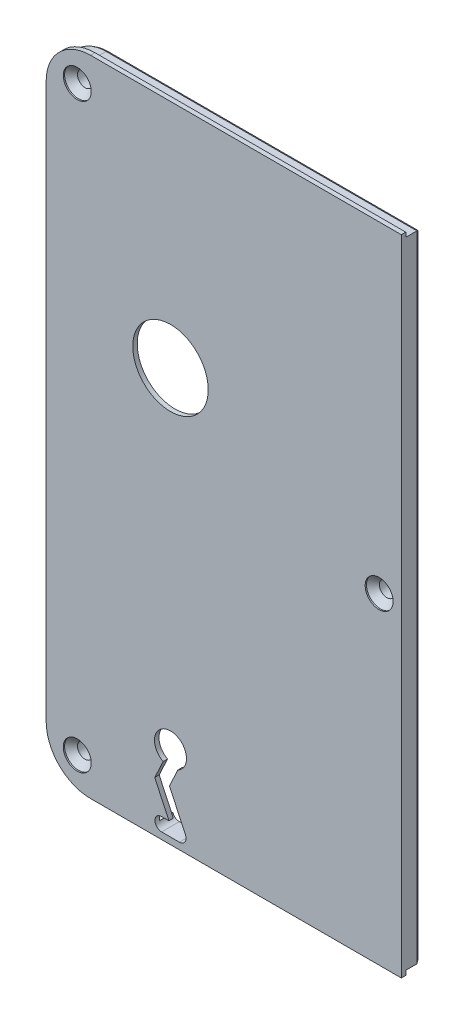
ISO-10303-21;
HEADER;
FILE_DESCRIPTION(('STEP AP214'),'2;1');
FILE_NAME('part.step','',(''),(''),'','','');
FILE_SCHEMA(('AUTOMOTIVE_DESIGN { 1 0 10303 214 1 1 1 1 }'));
ENDSEC;
DATA;
#1=APPLICATION_CONTEXT('core data for automotive mechanical design processes');
#2=APPLICATION_PROTOCOL_DEFINITION('international standard','automotive_design',2000,#1);
#3=PRODUCT_CONTEXT('',#1,'mechanical');
#4=PRODUCT('Part','Part','',(#3));
#5=PRODUCT_RELATED_PRODUCT_CATEGORY('part','',(#4));
#6=PRODUCT_DEFINITION_FORMATION('','',#4);
#7=PRODUCT_DEFINITION_CONTEXT('part definition',#1,'design');
#8=PRODUCT_DEFINITION('design','',#6,#7);
#9=PRODUCT_DEFINITION_SHAPE('','',#8);
#10=(LENGTH_UNIT() NAMED_UNIT(*) SI_UNIT(.MILLI.,.METRE.));
#11=(NAMED_UNIT(*) PLANE_ANGLE_UNIT() SI_UNIT($,.RADIAN.));
#12=(NAMED_UNIT(*) SI_UNIT($,.STERADIAN.) SOLID_ANGLE_UNIT());
#13=UNCERTAINTY_MEASURE_WITH_UNIT(LENGTH_MEASURE(1.E-05),#10,'distance_accuracy_value','');
#14=(GEOMETRIC_REPRESENTATION_CONTEXT(3) GLOBAL_UNCERTAINTY_ASSIGNED_CONTEXT((#13)) GLOBAL_UNIT_ASSIGNED_CONTEXT((#10,
#11,#12)) REPRESENTATION_CONTEXT('',''));
#15=CARTESIAN_POINT('',(0.,0.,0.));
#16=DIRECTION('',(0.,0.,1.));
#17=DIRECTION('',(1.,0.,0.));
#18=AXIS2_PLACEMENT_3D('',#15,#16,#17);
#19=CARTESIAN_POINT('',(-70.,-62.5,0.));
#20=DIRECTION('',(0.,0.,1.));
#21=DIRECTION('',(1.,0.,0.));
#22=AXIS2_PLACEMENT_3D('',#19,#20,#21);
#23=PLANE('',#22);
#24=CARTESIAN_POINT('',(-51.9999999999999,20.5,0.));
#25=DIRECTION('',(0.,0.,1.));
#26=DIRECTION('',(1.,0.,0.));
#27=AXIS2_PLACEMENT_3D('',#24,#25,#26);
#28=CIRCLE('',#27,8.5);
#29=CARTESIAN_POINT('',(-43.4999999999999,20.5,0.));
#30=VERTEX_POINT('',#29);
#31=EDGE_CURVE('E635',#30,#30,#28,.T.);
#32=ORIENTED_EDGE('',*,*,#31,.F.);
#33=EDGE_LOOP('',(#32));
#34=FACE_BOUND('',#33,.T.);
#35=DIRECTION('',(1.,0.,0.));
#36=VECTOR('',#35,1.);
#37=CARTESIAN_POINT('',(0.,-72.5,0.));
#38=LINE('',#37,#36);
#39=CARTESIAN_POINT('',(-70.,-72.5,0.));
#40=VERTEX_POINT('',#39);
#41=CARTESIAN_POINT('',(0.,-72.5,0.));
#42=VERTEX_POINT('',#41);
#43=EDGE_CURVE('E652',#40,#42,#38,.T.);
#44=ORIENTED_EDGE('',*,*,#43,.T.);
#45=DIRECTION('',(0.,1.,0.));
#46=VECTOR('',#45,1.);
#47=CARTESIAN_POINT('',(0.,-72.5,0.));
#48=LINE('',#47,#46);
#49=CARTESIAN_POINT('',(0.,72.5,0.));
#50=VERTEX_POINT('',#49);
#51=EDGE_CURVE('E874',#42,#50,#48,.T.);
#52=ORIENTED_EDGE('',*,*,#51,.T.);
#53=DIRECTION('',(-1.,0.,0.));
#54=VECTOR('',#53,1.);
#55=CARTESIAN_POINT('',(0.,72.5,0.));
#56=LINE('',#55,#54);
#57=CARTESIAN_POINT('',(-70.,72.5,0.));
#58=VERTEX_POINT('',#57);
#59=EDGE_CURVE('E871',#50,#58,#56,.T.);
#60=ORIENTED_EDGE('',*,*,#59,.T.);
#61=CARTESIAN_POINT('',(-70.,62.5,0.));
#62=DIRECTION('',(0.,0.,1.));
#63=DIRECTION('',(1.,0.,0.));
#64=AXIS2_PLACEMENT_3D('',#61,#62,#63);
#65=CIRCLE('',#64,9.99999999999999);
#66=CARTESIAN_POINT('',(-80.,62.5,0.));
#67=VERTEX_POINT('',#66);
#68=EDGE_CURVE('E868',#58,#67,#65,.T.);
#69=ORIENTED_EDGE('',*,*,#68,.T.);
#70=DIRECTION('',(0.,-1.,0.));
#71=VECTOR('',#70,1.);
#72=CARTESIAN_POINT('',(-80.,62.5,0.));
#73=LINE('',#72,#71);
#74=CARTESIAN_POINT('',(-80.,-62.5,0.));
#75=VERTEX_POINT('',#74);
#76=EDGE_CURVE('E865',#67,#75,#73,.T.);
#77=ORIENTED_EDGE('',*,*,#76,.T.);
#78=CARTESIAN_POINT('',(-70.,-62.5,0.));
#79=DIRECTION('',(0.,0.,1.));
#80=DIRECTION('',(1.,0.,0.));
#81=AXIS2_PLACEMENT_3D('',#78,#79,#80);
#82=CIRCLE('',#81,9.99999999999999);
#83=EDGE_CURVE('E844',#75,#40,#82,.T.);
#84=ORIENTED_EDGE('',*,*,#83,.T.);
#85=EDGE_LOOP('',(#44,#52,#60,#69,#77,#84));
#86=FACE_BOUND('',#85,.T.);
#87=CARTESIAN_POINT('',(-73.,-65.5,0.));
#88=DIRECTION('',(0.,0.,1.));
#89=DIRECTION('',(1.,0.,0.));
#90=AXIS2_PLACEMENT_3D('',#87,#88,#89);
#91=CIRCLE('',#90,3.15);
#92=CARTESIAN_POINT('',(-69.85,-65.5,0.));
#93=VERTEX_POINT('',#92);
#94=EDGE_CURVE('E409',#93,#93,#91,.T.);
#95=ORIENTED_EDGE('',*,*,#94,.F.);
#96=EDGE_LOOP('',(#95));
#97=FACE_BOUND('',#96,.T.);
#98=CARTESIAN_POINT('',(-5.,0.,0.));
#99=DIRECTION('',(0.,0.,1.));
#100=DIRECTION('',(1.,0.,0.));
#101=AXIS2_PLACEMENT_3D('',#98,#99,#100);
#102=CIRCLE('',#101,3.15);
#103=CARTESIAN_POINT('',(-1.85,0.,0.));
#104=VERTEX_POINT('',#103);
#105=EDGE_CURVE('E414',#104,#104,#102,.T.);
#106=ORIENTED_EDGE('',*,*,#105,.F.);
#107=EDGE_LOOP('',(#106));
#108=FACE_BOUND('',#107,.T.);
#109=CARTESIAN_POINT('',(-73.,65.5,0.));
#110=DIRECTION('',(0.,0.,1.));
#111=DIRECTION('',(1.,0.,0.));
#112=AXIS2_PLACEMENT_3D('',#109,#110,#111);
#113=CIRCLE('',#112,3.15);
#114=CARTESIAN_POINT('',(-69.85,65.5,0.));
#115=VERTEX_POINT('',#114);
#116=EDGE_CURVE('E460',#115,#115,#113,.T.);
#117=ORIENTED_EDGE('',*,*,#116,.F.);
#118=EDGE_LOOP('',(#117));
#119=FACE_BOUND('',#118,.T.);
#120=DIRECTION('',(0.4226182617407,0.90630778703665,0.));
#121=VECTOR('',#120,1.);
#122=CARTESIAN_POINT('',(-53.6550668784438,-57.0969913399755,0.));
#123=LINE('',#122,#121);
#124=CARTESIAN_POINT('',(-55.5468758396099,-61.1539887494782,0.));
#125=VERTEX_POINT('',#124);
#126=CARTESIAN_POINT('',(-53.6550668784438,-57.0969913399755,0.));
#127=VERTEX_POINT('',#126);
#128=EDGE_CURVE('E566',#125,#127,#123,.T.);
#129=ORIENTED_EDGE('',*,*,#128,.T.);
#130=CARTESIAN_POINT('',(-52.,-53.9,0.));
#131=DIRECTION('',(0.,0.,-1.));
#132=DIRECTION('',(1.,0.,0.));
#133=AXIS2_PLACEMENT_3D('',#130,#131,#132);
#134=CIRCLE('',#133,3.59999999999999);
#135=CARTESIAN_POINT('',(-50.3449331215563,-57.0969913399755,0.));
#136=VERTEX_POINT('',#135);
#137=EDGE_CURVE('E48',#127,#136,#134,.T.);
#138=ORIENTED_EDGE('',*,*,#137,.T.);
#139=DIRECTION('',(-0.422618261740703,-0.906307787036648,0.));
#140=VECTOR('',#139,1.);
#141=CARTESIAN_POINT('',(-50.3449331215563,-57.0969913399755,0.));
#142=LINE('',#141,#140);
#143=CARTESIAN_POINT('',(-52.2367420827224,-61.1539887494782,0.));
#144=VERTEX_POINT('',#143);
#145=EDGE_CURVE('E542',#136,#144,#142,.T.);
#146=ORIENTED_EDGE('',*,*,#145,.T.);
#147=DIRECTION('',(0.422618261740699,-0.90630778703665,0.));
#148=VECTOR('',#147,1.);
#149=CARTESIAN_POINT('',(-52.2367420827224,-61.1539887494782,0.));
#150=LINE('',#149,#148);
#151=CARTESIAN_POINT('',(-48.6405383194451,-68.8660726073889,0.));
#152=VERTEX_POINT('',#151);
#153=EDGE_CURVE('E548',#144,#152,#150,.T.);
#154=ORIENTED_EDGE('',*,*,#153,.T.);
#155=CARTESIAN_POINT('',(-50.,-69.5,0.));
#156=DIRECTION('',(0.,0.,-1.));
#157=DIRECTION('',(-1.,0.,0.));
#158=AXIS2_PLACEMENT_3D('',#155,#156,#157);
#159=CIRCLE('',#158,1.49999999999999);
#160=CARTESIAN_POINT('',(-50.,-71.,0.));
#161=VERTEX_POINT('',#160);
#162=EDGE_CURVE('E551',#152,#161,#159,.T.);
#163=ORIENTED_EDGE('',*,*,#162,.T.);
#164=DIRECTION('',(-1.,0.,0.));
#165=VECTOR('',#164,1.);
#166=CARTESIAN_POINT('',(-50.,-71.,0.));
#167=LINE('',#166,#165);
#168=CARTESIAN_POINT('',(-54.,-71.,0.));
#169=VERTEX_POINT('',#168);
#170=EDGE_CURVE('E554',#161,#169,#167,.T.);
#171=ORIENTED_EDGE('',*,*,#170,.T.);
#172=CARTESIAN_POINT('',(-54.,-69.5,0.));
#173=DIRECTION('',(0.,0.,-1.));
#174=DIRECTION('',(1.,0.,0.));
#175=AXIS2_PLACEMENT_3D('',#172,#173,#174);
#176=CIRCLE('',#175,1.5);
#177=CARTESIAN_POINT('',(-54.,-68.,0.));
#178=VERTEX_POINT('',#177);
#179=EDGE_CURVE('E557',#169,#178,#176,.T.);
#180=ORIENTED_EDGE('',*,*,#179,.T.);
#181=DIRECTION('',(1.,0.,0.));
#182=VECTOR('',#181,1.);
#183=CARTESIAN_POINT('',(-52.3545283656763,-68.,0.));
#184=LINE('',#183,#182);
#185=CARTESIAN_POINT('',(-52.3545283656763,-68.,0.));
#186=VERTEX_POINT('',#185);
#187=EDGE_CURVE('E560',#178,#186,#184,.T.);
#188=ORIENTED_EDGE('',*,*,#187,.T.);
#189=DIRECTION('',(-0.422618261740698,0.906307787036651,0.));
#190=VECTOR('',#189,1.);
#191=CARTESIAN_POINT('',(-55.5468758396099,-61.1539887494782,0.));
#192=LINE('',#191,#190);
#193=EDGE_CURVE('E563',#186,#125,#192,.T.);
#194=ORIENTED_EDGE('',*,*,#193,.T.);
#195=EDGE_LOOP('',(#129,#138,#146,#154,#163,#171,#180,#188,#194));
#196=FACE_BOUND('',#195,.T.);
#197=ADVANCED_FACE('F31',(#34,#86,#97,#108,#119,#196),#23,.T.);
#198=CARTESIAN_POINT('',(-70.,62.5,-4.));
#199=DIRECTION('',(0.,0.,1.));
#200=DIRECTION('',(1.,0.,0.));
#201=AXIS2_PLACEMENT_3D('',#198,#199,#200);
#202=PLANE('',#201);
#203=CARTESIAN_POINT('',(-73.,-65.5,-4.));
#204=DIRECTION('',(0.,0.,1.));
#205=DIRECTION('',(1.,0.,0.));
#206=AXIS2_PLACEMENT_3D('',#203,#204,#205);
#207=CIRCLE('',#206,1.724975);
#208=CARTESIAN_POINT('',(-71.275025,-65.5,-4.));
#209=VERTEX_POINT('',#208);
#210=EDGE_CURVE('E401',#209,#209,#207,.T.);
#211=ORIENTED_EDGE('',*,*,#210,.T.);
#212=EDGE_LOOP('',(#211));
#213=FACE_BOUND('',#212,.T.);
#214=CARTESIAN_POINT('',(-5.,0.,-4.));
#215=DIRECTION('',(0.,0.,1.));
#216=DIRECTION('',(1.,0.,0.));
#217=AXIS2_PLACEMENT_3D('',#214,#215,#216);
#218=CIRCLE('',#217,1.724975);
#219=CARTESIAN_POINT('',(-3.275025,0.,-4.));
#220=VERTEX_POINT('',#219);
#221=EDGE_CURVE('E406',#220,#220,#218,.T.);
#222=ORIENTED_EDGE('',*,*,#221,.T.);
#223=EDGE_LOOP('',(#222));
#224=FACE_BOUND('',#223,.T.);
#225=CARTESIAN_POINT('',(-73.,65.5,-4.));
#226=DIRECTION('',(0.,0.,1.));
#227=DIRECTION('',(1.,0.,0.));
#228=AXIS2_PLACEMENT_3D('',#225,#226,#227);
#229=CIRCLE('',#228,1.724975);
#230=CARTESIAN_POINT('',(-71.275025,65.5,-4.));
#231=VERTEX_POINT('',#230);
#232=EDGE_CURVE('E411',#231,#231,#229,.T.);
#233=ORIENTED_EDGE('',*,*,#232,.T.);
#234=EDGE_LOOP('',(#233));
#235=FACE_BOUND('',#234,.T.);
#236=CARTESIAN_POINT('',(-70.,62.5,-4.));
#237=DIRECTION('',(0.,0.,1.));
#238=DIRECTION('',(1.,0.,0.));
#239=AXIS2_PLACEMENT_3D('',#236,#237,#238);
#240=CIRCLE('',#239,8.71132486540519);
#241=CARTESIAN_POINT('',(-78.7113248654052,62.5,-4.));
#242=VERTEX_POINT('',#241);
#243=CARTESIAN_POINT('',(-70.,71.2113248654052,-4.));
#244=VERTEX_POINT('',#243);
#245=EDGE_CURVE('E424',#242,#244,#240,.F.);
#246=ORIENTED_EDGE('',*,*,#245,.T.);
#247=DIRECTION('',(1.,0.,0.));
#248=VECTOR('',#247,1.);
#249=CARTESIAN_POINT('',(-70.,71.2113248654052,-4.));
#250=LINE('',#249,#248);
#251=CARTESIAN_POINT('',(-0.288675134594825,71.2113248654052,-4.));
#252=VERTEX_POINT('',#251);
#253=EDGE_CURVE('E386',#244,#252,#250,.T.);
#254=ORIENTED_EDGE('',*,*,#253,.T.);
#255=DIRECTION('',(0.,-1.,0.));
#256=VECTOR('',#255,1.);
#257=CARTESIAN_POINT('',(-0.288675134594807,-71.5,-4.));
#258=LINE('',#257,#256);
#259=CARTESIAN_POINT('',(-0.288675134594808,-71.2113248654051,-4.));
#260=VERTEX_POINT('',#259);
#261=EDGE_CURVE('E423',#252,#260,#258,.T.);
#262=ORIENTED_EDGE('',*,*,#261,.T.);
#263=DIRECTION('',(-1.,0.,0.));
#264=VECTOR('',#263,1.);
#265=CARTESIAN_POINT('',(-70.,-71.2113248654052,-4.));
#266=LINE('',#265,#264);
#267=CARTESIAN_POINT('',(-70.,-71.2113248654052,-4.));
#268=VERTEX_POINT('',#267);
#269=EDGE_CURVE('E421',#260,#268,#266,.T.);
#270=ORIENTED_EDGE('',*,*,#269,.T.);
#271=CARTESIAN_POINT('',(-70.,-62.5,-4.));
#272=DIRECTION('',(0.,0.,1.));
#273=DIRECTION('',(1.,0.,0.));
#274=AXIS2_PLACEMENT_3D('',#271,#272,#273);
#275=CIRCLE('',#274,8.71132486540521);
#276=CARTESIAN_POINT('',(-78.7113248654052,-62.5,-4.));
#277=VERTEX_POINT('',#276);
#278=EDGE_CURVE('E418',#268,#277,#275,.F.);
#279=ORIENTED_EDGE('',*,*,#278,.T.);
#280=DIRECTION('',(0.,1.,0.));
#281=VECTOR('',#280,1.);
#282=CARTESIAN_POINT('',(-78.7113248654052,62.5,-4.));
#283=LINE('',#282,#281);
#284=EDGE_CURVE('E416',#277,#242,#283,.T.);
#285=ORIENTED_EDGE('',*,*,#284,.T.);
#286=EDGE_LOOP('',(#246,#254,#262,#270,#279,#285));
#287=FACE_BOUND('',#286,.T.);
#288=CARTESIAN_POINT('',(-50.,-69.5,-4.));
#289=DIRECTION('',(0.,0.,1.));
#290=DIRECTION('',(1.,0.,0.));
#291=AXIS2_PLACEMENT_3D('',#288,#289,#290);
#292=CIRCLE('',#291,1.49999999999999);
#293=CARTESIAN_POINT('',(-50.,-71.,-4.));
#294=VERTEX_POINT('',#293);
#295=CARTESIAN_POINT('',(-48.5857864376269,-70.,-4.));
#296=VERTEX_POINT('',#295);
#297=EDGE_CURVE('E538',#294,#296,#292,.T.);
#298=ORIENTED_EDGE('',*,*,#297,.T.);
#299=DIRECTION('',(-1.,0.,0.));
#300=VECTOR('',#299,1.);
#301=CARTESIAN_POINT('',(-1.50000000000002,-70.,-4.));
#302=LINE('',#301,#300);
#303=CARTESIAN_POINT('',(-1.50000000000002,-70.,-4.));
#304=VERTEX_POINT('',#303);
#305=EDGE_CURVE('E298',#304,#296,#302,.T.);
#306=ORIENTED_EDGE('',*,*,#305,.F.);
#307=DIRECTION('',(0.,-1.,0.));
#308=VECTOR('',#307,1.);
#309=CARTESIAN_POINT('',(-1.5,-5.,-4.));
#310=LINE('',#309,#308);
#311=CARTESIAN_POINT('',(-1.5,-5.,-4.));
#312=VERTEX_POINT('',#311);
#313=EDGE_CURVE('E505',#312,#304,#310,.T.);
#314=ORIENTED_EDGE('',*,*,#313,.F.);
#315=DIRECTION('',(1.,0.,0.));
#316=VECTOR('',#315,1.);
#317=CARTESIAN_POINT('',(-10.,-5.,-4.));
#318=LINE('',#317,#316);
#319=CARTESIAN_POINT('',(-10.,-5.,-4.));
#320=VERTEX_POINT('',#319);
#321=EDGE_CURVE('E503',#320,#312,#318,.T.);
#322=ORIENTED_EDGE('',*,*,#321,.F.);
#323=DIRECTION('',(0.,-1.,0.));
#324=VECTOR('',#323,1.);
#325=CARTESIAN_POINT('',(-10.,5.,-4.));
#326=LINE('',#325,#324);
#327=CARTESIAN_POINT('',(-10.,5.,-4.));
#328=VERTEX_POINT('',#327);
#329=EDGE_CURVE('E501',#328,#320,#326,.T.);
#330=ORIENTED_EDGE('',*,*,#329,.F.);
#331=DIRECTION('',(-1.,0.,0.));
#332=VECTOR('',#331,1.);
#333=CARTESIAN_POINT('',(-1.5,5.,-4.));
#334=LINE('',#333,#332);
#335=CARTESIAN_POINT('',(-1.5,5.,-4.));
#336=VERTEX_POINT('',#335);
#337=EDGE_CURVE('E331',#336,#328,#334,.T.);
#338=ORIENTED_EDGE('',*,*,#337,.F.);
#339=DIRECTION('',(0.,-1.,0.));
#340=VECTOR('',#339,1.);
#341=CARTESIAN_POINT('',(-1.50000000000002,70.,-4.));
#342=LINE('',#341,#340);
#343=CARTESIAN_POINT('',(-1.50000000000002,70.,-4.));
#344=VERTEX_POINT('',#343);
#345=EDGE_CURVE('E336',#344,#336,#342,.T.);
#346=ORIENTED_EDGE('',*,*,#345,.F.);
#347=DIRECTION('',(1.,0.,0.));
#348=VECTOR('',#347,1.);
#349=CARTESIAN_POINT('',(-69.,70.,-4.));
#350=LINE('',#349,#348);
#351=CARTESIAN_POINT('',(-69.,70.,-4.));
#352=VERTEX_POINT('',#351);
#353=EDGE_CURVE('E519',#352,#344,#350,.T.);
#354=ORIENTED_EDGE('',*,*,#353,.F.);
#355=DIRECTION('',(0.,1.,0.));
#356=VECTOR('',#355,1.);
#357=CARTESIAN_POINT('',(-69.,61.5,-4.));
#358=LINE('',#357,#356);
#359=CARTESIAN_POINT('',(-69.,61.5,-4.));
#360=VERTEX_POINT('',#359);
#361=EDGE_CURVE('E517',#360,#352,#358,.T.);
#362=ORIENTED_EDGE('',*,*,#361,.F.);
#363=DIRECTION('',(1.,0.,0.));
#364=VECTOR('',#363,1.);
#365=CARTESIAN_POINT('',(-77.5,61.5,-4.));
#366=LINE('',#365,#364);
#367=CARTESIAN_POINT('',(-77.5,61.5,-4.));
#368=VERTEX_POINT('',#367);
#369=EDGE_CURVE('E515',#368,#360,#366,.T.);
#370=ORIENTED_EDGE('',*,*,#369,.F.);
#371=DIRECTION('',(0.,1.,0.));
#372=VECTOR('',#371,1.);
#373=CARTESIAN_POINT('',(-77.5,-61.5,-4.));
#374=LINE('',#373,#372);
#375=CARTESIAN_POINT('',(-77.5,-61.5,-4.));
#376=VERTEX_POINT('',#375);
#377=EDGE_CURVE('E513',#376,#368,#374,.T.);
#378=ORIENTED_EDGE('',*,*,#377,.F.);
#379=DIRECTION('',(-1.,0.,0.));
#380=VECTOR('',#379,1.);
#381=CARTESIAN_POINT('',(-69.,-61.5,-4.));
#382=LINE('',#381,#380);
#383=CARTESIAN_POINT('',(-69.,-61.5,-4.));
#384=VERTEX_POINT('',#383);
#385=EDGE_CURVE('E511',#384,#376,#382,.T.);
#386=ORIENTED_EDGE('',*,*,#385,.F.);
#387=DIRECTION('',(0.,1.,0.));
#388=VECTOR('',#387,1.);
#389=CARTESIAN_POINT('',(-69.,-70.,-4.));
#390=LINE('',#389,#388);
#391=CARTESIAN_POINT('',(-69.,-70.,-4.));
#392=VERTEX_POINT('',#391);
#393=EDGE_CURVE('E509',#392,#384,#390,.T.);
#394=ORIENTED_EDGE('',*,*,#393,.F.);
#395=CARTESIAN_POINT('',(-55.4142135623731,-70.,-4.));
#396=VERTEX_POINT('',#395);
#397=EDGE_CURVE('E507',#396,#392,#302,.T.);
#398=ORIENTED_EDGE('',*,*,#397,.F.);
#399=CARTESIAN_POINT('',(-54.,-69.5,-4.));
#400=DIRECTION('',(0.,0.,1.));
#401=DIRECTION('',(1.,0.,0.));
#402=AXIS2_PLACEMENT_3D('',#399,#400,#401);
#403=CIRCLE('',#402,1.5);
#404=CARTESIAN_POINT('',(-54.,-71.,-4.));
#405=VERTEX_POINT('',#404);
#406=EDGE_CURVE('E443',#396,#405,#403,.T.);
#407=ORIENTED_EDGE('',*,*,#406,.T.);
#408=DIRECTION('',(1.,0.,0.));
#409=VECTOR('',#408,1.);
#410=CARTESIAN_POINT('',(-50.,-71.,-4.));
#411=LINE('',#410,#409);
#412=EDGE_CURVE('E299',#405,#294,#411,.T.);
#413=ORIENTED_EDGE('',*,*,#412,.T.);
#414=EDGE_LOOP('',(#298,#306,#314,#322,#330,#338,#346,#354,#362,#370,#378,#386,#394,#398,#407,#413));
#415=FACE_BOUND('',#414,.T.);
#416=ADVANCED_FACE('F430',(#213,#224,#235,#287,#415),#202,.F.);
#417=CARTESIAN_POINT('',(-1.50000000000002,-70.,-4.));
#418=DIRECTION('',(0.,1.,0.));
#419=DIRECTION('',(0.,0.,1.));
#420=AXIS2_PLACEMENT_3D('',#417,#418,#419);
#421=PLANE('',#420);
#422=ORIENTED_EDGE('',*,*,#305,.T.);
#423=DIRECTION('',(0.,0.,1.));
#424=VECTOR('',#423,1.);
#425=CARTESIAN_POINT('',(-48.5857864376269,-70.,-4.001));
#426=LINE('',#425,#424);
#427=CARTESIAN_POINT('',(-48.5857864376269,-70.,-1.));
#428=VERTEX_POINT('',#427);
#429=EDGE_CURVE('E281',#428,#296,#426,.F.);
#430=ORIENTED_EDGE('',*,*,#429,.F.);
#431=DIRECTION('',(-1.,0.,0.));
#432=VECTOR('',#431,1.);
#433=CARTESIAN_POINT('',(-1.50000000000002,-70.,-1.));
#434=LINE('',#433,#432);
#435=CARTESIAN_POINT('',(-1.50000000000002,-70.,-1.));
#436=VERTEX_POINT('',#435);
#437=EDGE_CURVE('E295',#436,#428,#434,.T.);
#438=ORIENTED_EDGE('',*,*,#437,.F.);
#439=DIRECTION('',(0.,0.,1.));
#440=VECTOR('',#439,1.);
#441=CARTESIAN_POINT('',(-1.50000000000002,-70.,-4.));
#442=LINE('',#441,#440);
#443=EDGE_CURVE('E352',#304,#436,#442,.T.);
#444=ORIENTED_EDGE('',*,*,#443,.F.);
#445=EDGE_LOOP('',(#422,#430,#438,#444));
#446=FACE_BOUND('',#445,.T.);
#447=ADVANCED_FACE('F293',(#446),#421,.T.);
#448=CARTESIAN_POINT('',(-55.4142135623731,-70.,-1.));
#449=VERTEX_POINT('',#448);
#450=CARTESIAN_POINT('',(-69.,-70.,-1.));
#451=VERTEX_POINT('',#450);
#452=EDGE_CURVE('E306',#449,#451,#434,.T.);
#453=ORIENTED_EDGE('',*,*,#452,.F.);
#454=DIRECTION('',(0.,0.,1.));
#455=VECTOR('',#454,1.);
#456=CARTESIAN_POINT('',(-55.4142135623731,-70.,-4.001));
#457=LINE('',#456,#455);
#458=EDGE_CURVE('E587',#396,#449,#457,.T.);
#459=ORIENTED_EDGE('',*,*,#458,.F.);
#460=ORIENTED_EDGE('',*,*,#397,.T.);
#461=DIRECTION('',(0.,0.,1.));
#462=VECTOR('',#461,1.);
#463=CARTESIAN_POINT('',(-69.,-70.,-4.));
#464=LINE('',#463,#462);
#465=EDGE_CURVE('E349',#392,#451,#464,.T.);
#466=ORIENTED_EDGE('',*,*,#465,.T.);
#467=EDGE_LOOP('',(#453,#459,#460,#466));
#468=FACE_BOUND('',#467,.T.);
#469=ADVANCED_FACE('F598',(#468),#421,.T.);
#470=CARTESIAN_POINT('',(-70.,-62.5,-1.));
#471=DIRECTION('',(0.,0.,1.));
#472=DIRECTION('',(1.,0.,0.));
#473=AXIS2_PLACEMENT_3D('',#470,#471,#472);
#474=PLANE('',#473);
#475=CARTESIAN_POINT('',(-51.9999999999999,20.5,-1.));
#476=DIRECTION('',(0.,0.,1.));
#477=DIRECTION('',(1.,0.,0.));
#478=AXIS2_PLACEMENT_3D('',#475,#476,#477);
#479=CIRCLE('',#478,8.5);
#480=CARTESIAN_POINT('',(-43.4999999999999,20.5,-1.));
#481=VERTEX_POINT('',#480);
#482=EDGE_CURVE('E633',#481,#481,#479,.F.);
#483=ORIENTED_EDGE('',*,*,#482,.F.);
#484=EDGE_LOOP('',(#483));
#485=FACE_BOUND('',#484,.T.);
#486=CARTESIAN_POINT('',(-50.,-69.5,-1.));
#487=DIRECTION('',(0.,0.,1.));
#488=DIRECTION('',(1.,0.,0.));
#489=AXIS2_PLACEMENT_3D('',#486,#487,#488);
#490=CIRCLE('',#489,1.49999999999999);
#491=CARTESIAN_POINT('',(-48.6405383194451,-68.8660726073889,-1.));
#492=VERTEX_POINT('',#491);
#493=EDGE_CURVE('E278',#428,#492,#490,.T.);
#494=ORIENTED_EDGE('',*,*,#493,.T.);
#495=DIRECTION('',(-0.422618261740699,0.90630778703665,0.));
#496=VECTOR('',#495,1.);
#497=CARTESIAN_POINT('',(-52.2367420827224,-61.1539887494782,-1.));
#498=LINE('',#497,#496);
#499=CARTESIAN_POINT('',(-52.2367420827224,-61.1539887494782,-1.));
#500=VERTEX_POINT('',#499);
#501=EDGE_CURVE('E288',#492,#500,#498,.T.);
#502=ORIENTED_EDGE('',*,*,#501,.T.);
#503=DIRECTION('',(0.422618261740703,0.906307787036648,0.));
#504=VECTOR('',#503,1.);
#505=CARTESIAN_POINT('',(-50.3449331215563,-57.0969913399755,-1.));
#506=LINE('',#505,#504);
#507=CARTESIAN_POINT('',(-50.3449331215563,-57.0969913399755,-1.));
#508=VERTEX_POINT('',#507);
#509=EDGE_CURVE('E609',#500,#508,#506,.T.);
#510=ORIENTED_EDGE('',*,*,#509,.T.);
#511=CARTESIAN_POINT('',(-52.,-53.9,-1.));
#512=DIRECTION('',(0.,0.,1.));
#513=DIRECTION('',(1.,0.,0.));
#514=AXIS2_PLACEMENT_3D('',#511,#512,#513);
#515=CIRCLE('',#514,3.59999999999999);
#516=CARTESIAN_POINT('',(-53.6550668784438,-57.0969913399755,-1.));
#517=VERTEX_POINT('',#516);
#518=EDGE_CURVE('E606',#508,#517,#515,.T.);
#519=ORIENTED_EDGE('',*,*,#518,.T.);
#520=DIRECTION('',(-0.4226182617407,-0.90630778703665,0.));
#521=VECTOR('',#520,1.);
#522=CARTESIAN_POINT('',(-53.6550668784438,-57.0969913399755,-1.));
#523=LINE('',#522,#521);
#524=CARTESIAN_POINT('',(-55.5468758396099,-61.1539887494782,-1.));
#525=VERTEX_POINT('',#524);
#526=EDGE_CURVE('E585',#517,#525,#523,.T.);
#527=ORIENTED_EDGE('',*,*,#526,.T.);
#528=DIRECTION('',(0.422618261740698,-0.906307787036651,0.));
#529=VECTOR('',#528,1.);
#530=CARTESIAN_POINT('',(-55.5468758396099,-61.1539887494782,-1.));
#531=LINE('',#530,#529);
#532=CARTESIAN_POINT('',(-52.3545283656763,-68.,-1.));
#533=VERTEX_POINT('',#532);
#534=EDGE_CURVE('E611',#525,#533,#531,.T.);
#535=ORIENTED_EDGE('',*,*,#534,.T.);
#536=DIRECTION('',(-1.,0.,0.));
#537=VECTOR('',#536,1.);
#538=CARTESIAN_POINT('',(-52.3545283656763,-68.,-1.));
#539=LINE('',#538,#537);
#540=CARTESIAN_POINT('',(-54.,-68.,-1.));
#541=VERTEX_POINT('',#540);
#542=EDGE_CURVE('E604',#533,#541,#539,.T.);
#543=ORIENTED_EDGE('',*,*,#542,.T.);
#544=CARTESIAN_POINT('',(-54.,-69.5,-1.));
#545=DIRECTION('',(0.,0.,1.));
#546=DIRECTION('',(1.,0.,0.));
#547=AXIS2_PLACEMENT_3D('',#544,#545,#546);
#548=CIRCLE('',#547,1.5);
#549=EDGE_CURVE('E602',#541,#449,#548,.T.);
#550=ORIENTED_EDGE('',*,*,#549,.T.);
#551=ORIENTED_EDGE('',*,*,#452,.T.);
#552=DIRECTION('',(0.,1.,0.));
#553=VECTOR('',#552,1.);
#554=CARTESIAN_POINT('',(-69.,-70.,-1.));
#555=LINE('',#554,#553);
#556=CARTESIAN_POINT('',(-69.,-61.5,-1.));
#557=VERTEX_POINT('',#556);
#558=EDGE_CURVE('E305',#451,#557,#555,.T.);
#559=ORIENTED_EDGE('',*,*,#558,.T.);
#560=DIRECTION('',(-1.,0.,0.));
#561=VECTOR('',#560,1.);
#562=CARTESIAN_POINT('',(-69.,-61.5,-1.));
#563=LINE('',#562,#561);
#564=CARTESIAN_POINT('',(-77.5,-61.5,-1.));
#565=VERTEX_POINT('',#564);
#566=EDGE_CURVE('E309',#557,#565,#563,.T.);
#567=ORIENTED_EDGE('',*,*,#566,.T.);
#568=DIRECTION('',(0.,1.,0.));
#569=VECTOR('',#568,1.);
#570=CARTESIAN_POINT('',(-77.5,-61.5,-1.));
#571=LINE('',#570,#569);
#572=CARTESIAN_POINT('',(-77.5,61.5,-1.));
#573=VERTEX_POINT('',#572);
#574=EDGE_CURVE('E316',#565,#573,#571,.T.);
#575=ORIENTED_EDGE('',*,*,#574,.T.);
#576=DIRECTION('',(1.,0.,0.));
#577=VECTOR('',#576,1.);
#578=CARTESIAN_POINT('',(-77.5,61.5,-1.));
#579=LINE('',#578,#577);
#580=CARTESIAN_POINT('',(-69.,61.5,-1.));
#581=VERTEX_POINT('',#580);
#582=EDGE_CURVE('E319',#573,#581,#579,.T.);
#583=ORIENTED_EDGE('',*,*,#582,.T.);
#584=DIRECTION('',(0.,1.,0.));
#585=VECTOR('',#584,1.);
#586=CARTESIAN_POINT('',(-69.,61.5,-1.));
#587=LINE('',#586,#585);
#588=CARTESIAN_POINT('',(-69.,70.,-1.));
#589=VERTEX_POINT('',#588);
#590=EDGE_CURVE('E322',#581,#589,#587,.T.);
#591=ORIENTED_EDGE('',*,*,#590,.T.);
#592=DIRECTION('',(1.,0.,0.));
#593=VECTOR('',#592,1.);
#594=CARTESIAN_POINT('',(-69.,70.,-1.));
#595=LINE('',#594,#593);
#596=CARTESIAN_POINT('',(-1.50000000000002,70.,-1.));
#597=VERTEX_POINT('',#596);
#598=EDGE_CURVE('E325',#589,#597,#595,.T.);
#599=ORIENTED_EDGE('',*,*,#598,.T.);
#600=DIRECTION('',(0.,-1.,0.));
#601=VECTOR('',#600,1.);
#602=CARTESIAN_POINT('',(-1.50000000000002,70.,-1.));
#603=LINE('',#602,#601);
#604=CARTESIAN_POINT('',(-1.5,5.,-1.));
#605=VERTEX_POINT('',#604);
#606=EDGE_CURVE('E328',#597,#605,#603,.T.);
#607=ORIENTED_EDGE('',*,*,#606,.T.);
#608=DIRECTION('',(-1.,0.,0.));
#609=VECTOR('',#608,1.);
#610=CARTESIAN_POINT('',(-1.5,5.,-1.));
#611=LINE('',#610,#609);
#612=CARTESIAN_POINT('',(-10.,5.,-1.));
#613=VERTEX_POINT('',#612);
#614=EDGE_CURVE('E404',#605,#613,#611,.T.);
#615=ORIENTED_EDGE('',*,*,#614,.T.);
#616=DIRECTION('',(0.,-1.,0.));
#617=VECTOR('',#616,1.);
#618=CARTESIAN_POINT('',(-10.,5.,-1.));
#619=LINE('',#618,#617);
#620=CARTESIAN_POINT('',(-10.,-5.,-1.));
#621=VERTEX_POINT('',#620);
#622=EDGE_CURVE('E525',#613,#621,#619,.T.);
#623=ORIENTED_EDGE('',*,*,#622,.T.);
#624=DIRECTION('',(1.,0.,0.));
#625=VECTOR('',#624,1.);
#626=CARTESIAN_POINT('',(-10.,-5.,-1.));
#627=LINE('',#626,#625);
#628=CARTESIAN_POINT('',(-1.5,-5.,-1.));
#629=VERTEX_POINT('',#628);
#630=EDGE_CURVE('E527',#621,#629,#627,.T.);
#631=ORIENTED_EDGE('',*,*,#630,.T.);
#632=DIRECTION('',(0.,-1.,0.));
#633=VECTOR('',#632,1.);
#634=CARTESIAN_POINT('',(-1.5,-5.,-1.));
#635=LINE('',#634,#633);
#636=EDGE_CURVE('E304',#629,#436,#635,.T.);
#637=ORIENTED_EDGE('',*,*,#636,.T.);
#638=ORIENTED_EDGE('',*,*,#437,.T.);
#639=EDGE_LOOP('',(#494,#502,#510,#519,#527,#535,#543,#550,#551,#559,#567,#575,#583,#591,#599,
#607,#615,#623,#631,#637,#638));
#640=FACE_BOUND('',#639,.T.);
#641=ADVANCED_FACE('F301',(#485,#640),#474,.F.);
#642=DIRECTION('',(-1.,0.,0.));
#643=VECTOR('',#642,1.);
#644=CARTESIAN_POINT('',(0.,-71.5,-1.));
#645=LINE('',#644,#643);
#646=CARTESIAN_POINT('',(0.,-71.5,-1.));
#647=VERTEX_POINT('',#646);
#648=CARTESIAN_POINT('',(-70.,-71.5,-1.));
#649=VERTEX_POINT('',#648);
#650=EDGE_CURVE('E373',#647,#649,#645,.T.);
#651=ORIENTED_EDGE('',*,*,#650,.F.);
#652=DIRECTION('',(0.,1.,0.));
#653=VECTOR('',#652,1.);
#654=CARTESIAN_POINT('',(0.,-72.5,-1.));
#655=LINE('',#654,#653);
#656=CARTESIAN_POINT('',(0.,-72.5,-1.));
#657=VERTEX_POINT('',#656);
#658=EDGE_CURVE('E850',#657,#647,#655,.T.);
#659=ORIENTED_EDGE('',*,*,#658,.F.);
#660=DIRECTION('',(1.,0.,0.));
#661=VECTOR('',#660,1.);
#662=CARTESIAN_POINT('',(0.,-72.5,-1.));
#663=LINE('',#662,#661);
#664=CARTESIAN_POINT('',(-70.,-72.5,-1.));
#665=VERTEX_POINT('',#664);
#666=EDGE_CURVE('E842',#665,#657,#663,.T.);
#667=ORIENTED_EDGE('',*,*,#666,.F.);
#668=CARTESIAN_POINT('',(-70.,-62.5,-1.));
#669=DIRECTION('',(0.,0.,1.));
#670=DIRECTION('',(1.,0.,0.));
#671=AXIS2_PLACEMENT_3D('',#668,#669,#670);
#672=CIRCLE('',#671,9.99999999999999);
#673=CARTESIAN_POINT('',(-80.,-62.5,-1.));
#674=VERTEX_POINT('',#673);
#675=EDGE_CURVE('E855',#674,#665,#672,.T.);
#676=ORIENTED_EDGE('',*,*,#675,.F.);
#677=DIRECTION('',(0.,-1.,0.));
#678=VECTOR('',#677,1.);
#679=CARTESIAN_POINT('',(-80.,62.5,-1.));
#680=LINE('',#679,#678);
#681=CARTESIAN_POINT('',(-80.,62.5,-1.));
#682=VERTEX_POINT('',#681);
#683=EDGE_CURVE('E879',#682,#674,#680,.T.);
#684=ORIENTED_EDGE('',*,*,#683,.F.);
#685=CARTESIAN_POINT('',(-70.,62.5,-1.));
#686=DIRECTION('',(0.,0.,1.));
#687=DIRECTION('',(1.,0.,0.));
#688=AXIS2_PLACEMENT_3D('',#685,#686,#687);
#689=CIRCLE('',#688,9.99999999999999);
#690=CARTESIAN_POINT('',(-70.,72.5,-1.));
#691=VERTEX_POINT('',#690);
#692=EDGE_CURVE('E881',#691,#682,#689,.T.);
#693=ORIENTED_EDGE('',*,*,#692,.F.);
#694=DIRECTION('',(-1.,0.,0.));
#695=VECTOR('',#694,1.);
#696=CARTESIAN_POINT('',(0.,72.5,-1.));
#697=LINE('',#696,#695);
#698=CARTESIAN_POINT('',(0.,72.5,-1.));
#699=VERTEX_POINT('',#698);
#700=EDGE_CURVE('E847',#699,#691,#697,.T.);
#701=ORIENTED_EDGE('',*,*,#700,.F.);
#702=CARTESIAN_POINT('',(0.,71.5,-1.));
#703=VERTEX_POINT('',#702);
#704=EDGE_CURVE('E374',#703,#699,#655,.T.);
#705=ORIENTED_EDGE('',*,*,#704,.F.);
#706=DIRECTION('',(1.,0.,0.));
#707=VECTOR('',#706,1.);
#708=CARTESIAN_POINT('',(-70.,71.5,-1.));
#709=LINE('',#708,#707);
#710=CARTESIAN_POINT('',(-70.,71.5,-1.));
#711=VERTEX_POINT('',#710);
#712=EDGE_CURVE('E364',#711,#703,#709,.T.);
#713=ORIENTED_EDGE('',*,*,#712,.F.);
#714=CARTESIAN_POINT('',(-70.,62.5,-1.));
#715=DIRECTION('',(0.,0.,-1.));
#716=DIRECTION('',(1.,0.,0.));
#717=AXIS2_PLACEMENT_3D('',#714,#715,#716);
#718=CIRCLE('',#717,8.99999999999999);
#719=CARTESIAN_POINT('',(-79.,62.5,-1.));
#720=VERTEX_POINT('',#719);
#721=EDGE_CURVE('E361',#720,#711,#718,.T.);
#722=ORIENTED_EDGE('',*,*,#721,.F.);
#723=DIRECTION('',(0.,1.,0.));
#724=VECTOR('',#723,1.);
#725=CARTESIAN_POINT('',(-79.,-62.5,-1.));
#726=LINE('',#725,#724);
#727=CARTESIAN_POINT('',(-79.,-62.5,-1.));
#728=VERTEX_POINT('',#727);
#729=EDGE_CURVE('E836',#728,#720,#726,.T.);
#730=ORIENTED_EDGE('',*,*,#729,.F.);
#731=CARTESIAN_POINT('',(-70.,-62.5,-1.));
#732=DIRECTION('',(0.,0.,-1.));
#733=DIRECTION('',(1.,0.,0.));
#734=AXIS2_PLACEMENT_3D('',#731,#732,#733);
#735=CIRCLE('',#734,9.00000000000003);
#736=EDGE_CURVE('E367',#649,#728,#735,.T.);
#737=ORIENTED_EDGE('',*,*,#736,.F.);
#738=EDGE_LOOP('',(#651,#659,#667,#676,#684,#693,#701,#705,#713,#722,#730,#737));
#739=FACE_BOUND('',#738,.T.);
#740=ADVANCED_FACE('F767',(#739),#474,.F.);
#741=CARTESIAN_POINT('',(0.,-72.5,-1.));
#742=DIRECTION('',(0.,-1.,0.));
#743=DIRECTION('',(1.,0.,0.));
#744=AXIS2_PLACEMENT_3D('',#741,#742,#743);
#745=PLANE('',#744);
#746=ORIENTED_EDGE('',*,*,#43,.F.);
#747=DIRECTION('',(0.,0.,1.));
#748=VECTOR('',#747,1.);
#749=CARTESIAN_POINT('',(-70.,-72.5,-1.));
#750=LINE('',#749,#748);
#751=EDGE_CURVE('E419',#665,#40,#750,.T.);
#752=ORIENTED_EDGE('',*,*,#751,.F.);
#753=ORIENTED_EDGE('',*,*,#666,.T.);
#754=DIRECTION('',(0.,0.,1.));
#755=VECTOR('',#754,1.);
#756=CARTESIAN_POINT('',(0.,-72.5,-1.));
#757=LINE('',#756,#755);
#758=EDGE_CURVE('E852',#657,#42,#757,.T.);
#759=ORIENTED_EDGE('',*,*,#758,.T.);
#760=EDGE_LOOP('',(#746,#752,#753,#759));
#761=FACE_BOUND('',#760,.T.);
#762=ADVANCED_FACE('F774',(#761),#745,.T.);
#763=CARTESIAN_POINT('',(-70.,-62.5,-1.));
#764=DIRECTION('',(0.,0.,1.));
#765=DIRECTION('',(1.,0.,0.));
#766=AXIS2_PLACEMENT_3D('',#763,#764,#765);
#767=CYLINDRICAL_SURFACE('',#766,9.99999999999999);
#768=ORIENTED_EDGE('',*,*,#83,.F.);
#769=DIRECTION('',(0.,0.,1.));
#770=VECTOR('',#769,1.);
#771=CARTESIAN_POINT('',(-80.,-62.5,-1.));
#772=LINE('',#771,#770);
#773=EDGE_CURVE('E861',#674,#75,#772,.T.);
#774=ORIENTED_EDGE('',*,*,#773,.F.);
#775=ORIENTED_EDGE('',*,*,#675,.T.);
#776=ORIENTED_EDGE('',*,*,#751,.T.);
#777=EDGE_LOOP('',(#768,#774,#775,#776));
#778=FACE_BOUND('',#777,.T.);
#779=ADVANCED_FACE('F770',(#778),#767,.T.);
#780=CARTESIAN_POINT('',(-80.,62.5,-1.));
#781=DIRECTION('',(-1.,0.,0.));
#782=DIRECTION('',(0.,-1.,0.));
#783=AXIS2_PLACEMENT_3D('',#780,#781,#782);
#784=PLANE('',#783);
#785=ORIENTED_EDGE('',*,*,#76,.F.);
#786=DIRECTION('',(0.,0.,1.));
#787=VECTOR('',#786,1.);
#788=CARTESIAN_POINT('',(-80.,62.5,-1.));
#789=LINE('',#788,#787);
#790=EDGE_CURVE('E859',#682,#67,#789,.T.);
#791=ORIENTED_EDGE('',*,*,#790,.F.);
#792=ORIENTED_EDGE('',*,*,#683,.T.);
#793=ORIENTED_EDGE('',*,*,#773,.T.);
#794=EDGE_LOOP('',(#785,#791,#792,#793));
#795=FACE_BOUND('',#794,.T.);
#796=ADVANCED_FACE('F773',(#795),#784,.T.);
#797=CARTESIAN_POINT('',(-70.,62.5,-1.));
#798=DIRECTION('',(0.,0.,1.));
#799=DIRECTION('',(1.,0.,0.));
#800=AXIS2_PLACEMENT_3D('',#797,#798,#799);
#801=CYLINDRICAL_SURFACE('',#800,9.99999999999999);
#802=ORIENTED_EDGE('',*,*,#68,.F.);
#803=DIRECTION('',(0.,0.,1.));
#804=VECTOR('',#803,1.);
#805=CARTESIAN_POINT('',(-70.,72.5,-1.));
#806=LINE('',#805,#804);
#807=EDGE_CURVE('E857',#691,#58,#806,.T.);
#808=ORIENTED_EDGE('',*,*,#807,.F.);
#809=ORIENTED_EDGE('',*,*,#692,.T.);
#810=ORIENTED_EDGE('',*,*,#790,.T.);
#811=EDGE_LOOP('',(#802,#808,#809,#810));
#812=FACE_BOUND('',#811,.T.);
#813=ADVANCED_FACE('F778',(#812),#801,.T.);
#814=CARTESIAN_POINT('',(0.,72.5,-1.));
#815=DIRECTION('',(0.,1.,0.));
#816=DIRECTION('',(-1.,0.,0.));
#817=AXIS2_PLACEMENT_3D('',#814,#815,#816);
#818=PLANE('',#817);
#819=ORIENTED_EDGE('',*,*,#59,.F.);
#820=DIRECTION('',(0.,0.,1.));
#821=VECTOR('',#820,1.);
#822=CARTESIAN_POINT('',(0.,72.5,-1.));
#823=LINE('',#822,#821);
#824=EDGE_CURVE('E854',#699,#50,#823,.T.);
#825=ORIENTED_EDGE('',*,*,#824,.F.);
#826=ORIENTED_EDGE('',*,*,#700,.T.);
#827=ORIENTED_EDGE('',*,*,#807,.T.);
#828=EDGE_LOOP('',(#819,#825,#826,#827));
#829=FACE_BOUND('',#828,.T.);
#830=ADVANCED_FACE('F782',(#829),#818,.T.);
#831=CARTESIAN_POINT('',(0.,-72.5,-1.));
#832=DIRECTION('',(1.,0.,0.));
#833=DIRECTION('',(0.,1.,0.));
#834=AXIS2_PLACEMENT_3D('',#831,#832,#833);
#835=PLANE('',#834);
#836=DIRECTION('',(0.,0.,1.));
#837=VECTOR('',#836,1.);
#838=CARTESIAN_POINT('',(0.,-71.5,-4.));
#839=LINE('',#838,#837);
#840=CARTESIAN_POINT('',(0.,-71.5,-3.5));
#841=VERTEX_POINT('',#840);
#842=EDGE_CURVE('E385',#841,#647,#839,.T.);
#843=ORIENTED_EDGE('',*,*,#842,.F.);
#844=DIRECTION('',(0.,1.,0.));
#845=VECTOR('',#844,1.);
#846=CARTESIAN_POINT('',(0.,71.5,-3.5));
#847=LINE('',#846,#845);
#848=CARTESIAN_POINT('',(0.,71.5,-3.5));
#849=VERTEX_POINT('',#848);
#850=EDGE_CURVE('E393',#841,#849,#847,.T.);
#851=ORIENTED_EDGE('',*,*,#850,.T.);
#852=DIRECTION('',(0.,0.,1.));
#853=VECTOR('',#852,1.);
#854=CARTESIAN_POINT('',(0.,71.5,-4.));
#855=LINE('',#854,#853);
#856=EDGE_CURVE('E381',#849,#703,#855,.T.);
#857=ORIENTED_EDGE('',*,*,#856,.T.);
#858=ORIENTED_EDGE('',*,*,#704,.T.);
#859=ORIENTED_EDGE('',*,*,#824,.T.);
#860=ORIENTED_EDGE('',*,*,#51,.F.);
#861=ORIENTED_EDGE('',*,*,#758,.F.);
#862=ORIENTED_EDGE('',*,*,#658,.T.);
#863=EDGE_LOOP('',(#843,#851,#857,#858,#859,#860,#861,#862));
#864=FACE_BOUND('',#863,.T.);
#865=ADVANCED_FACE('F764',(#864),#835,.T.);
#866=CARTESIAN_POINT('',(-70.,62.5,-4.));
#867=DIRECTION('',(0.,0.,1.));
#868=DIRECTION('',(1.,0.,0.));
#869=AXIS2_PLACEMENT_3D('',#866,#867,#868);
#870=CYLINDRICAL_SURFACE('',#869,8.99999999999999);
#871=DIRECTION('',(0.,0.,1.));
#872=VECTOR('',#871,1.);
#873=CARTESIAN_POINT('',(-70.,71.5,-4.));
#874=LINE('',#873,#872);
#875=CARTESIAN_POINT('',(-70.,71.5,-3.5));
#876=VERTEX_POINT('',#875);
#877=EDGE_CURVE('E384',#876,#711,#874,.T.);
#878=ORIENTED_EDGE('',*,*,#877,.F.);
#879=CARTESIAN_POINT('',(-70.,62.5,-3.5));
#880=DIRECTION('',(0.,0.,1.));
#881=DIRECTION('',(1.,0.,0.));
#882=AXIS2_PLACEMENT_3D('',#879,#880,#881);
#883=CIRCLE('',#882,8.99999999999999);
#884=CARTESIAN_POINT('',(-79.,62.5,-3.5));
#885=VERTEX_POINT('',#884);
#886=EDGE_CURVE('E391',#876,#885,#883,.T.);
#887=ORIENTED_EDGE('',*,*,#886,.T.);
#888=DIRECTION('',(0.,0.,1.));
#889=VECTOR('',#888,1.);
#890=CARTESIAN_POINT('',(-79.,62.5,-4.));
#891=LINE('',#890,#889);
#892=EDGE_CURVE('E834',#885,#720,#891,.T.);
#893=ORIENTED_EDGE('',*,*,#892,.T.);
#894=ORIENTED_EDGE('',*,*,#721,.T.);
#895=EDGE_LOOP('',(#878,#887,#893,#894));
#896=FACE_BOUND('',#895,.T.);
#897=ADVANCED_FACE('F760',(#896),#870,.T.);
#898=CARTESIAN_POINT('',(-70.,71.5,-4.));
#899=DIRECTION('',(0.,-1.,0.));
#900=DIRECTION('',(1.,0.,0.));
#901=AXIS2_PLACEMENT_3D('',#898,#899,#900);
#902=PLANE('',#901);
#903=ORIENTED_EDGE('',*,*,#856,.F.);
#904=DIRECTION('',(-1.,0.,0.));
#905=VECTOR('',#904,1.);
#906=CARTESIAN_POINT('',(-70.,71.5,-3.5));
#907=LINE('',#906,#905);
#908=EDGE_CURVE('E388',#849,#876,#907,.T.);
#909=ORIENTED_EDGE('',*,*,#908,.T.);
#910=ORIENTED_EDGE('',*,*,#877,.T.);
#911=ORIENTED_EDGE('',*,*,#712,.T.);
#912=EDGE_LOOP('',(#903,#909,#910,#911));
#913=FACE_BOUND('',#912,.T.);
#914=ADVANCED_FACE('F756',(#913),#902,.F.);
#915=CARTESIAN_POINT('',(0.,-71.5,-4.));
#916=DIRECTION('',(0.,1.,0.));
#917=DIRECTION('',(-1.,0.,0.));
#918=AXIS2_PLACEMENT_3D('',#915,#916,#917);
#919=PLANE('',#918);
#920=DIRECTION('',(0.,0.,1.));
#921=VECTOR('',#920,1.);
#922=CARTESIAN_POINT('',(-70.,-71.5,-4.));
#923=LINE('',#922,#921);
#924=CARTESIAN_POINT('',(-70.,-71.5,-3.5));
#925=VERTEX_POINT('',#924);
#926=EDGE_CURVE('E396',#925,#649,#923,.T.);
#927=ORIENTED_EDGE('',*,*,#926,.F.);
#928=DIRECTION('',(1.,0.,0.));
#929=VECTOR('',#928,1.);
#930=CARTESIAN_POINT('',(0.,-71.5,-3.5));
#931=LINE('',#930,#929);
#932=EDGE_CURVE('E818',#925,#841,#931,.T.);
#933=ORIENTED_EDGE('',*,*,#932,.T.);
#934=ORIENTED_EDGE('',*,*,#842,.T.);
#935=ORIENTED_EDGE('',*,*,#650,.T.);
#936=EDGE_LOOP('',(#927,#933,#934,#935));
#937=FACE_BOUND('',#936,.T.);
#938=ADVANCED_FACE('F752',(#937),#919,.F.);
#939=CARTESIAN_POINT('',(-70.,-62.5,-4.));
#940=DIRECTION('',(0.,0.,1.));
#941=DIRECTION('',(1.,0.,0.));
#942=AXIS2_PLACEMENT_3D('',#939,#940,#941);
#943=CYLINDRICAL_SURFACE('',#942,9.00000000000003);
#944=DIRECTION('',(0.,0.,1.));
#945=VECTOR('',#944,1.);
#946=CARTESIAN_POINT('',(-79.,-62.5,-4.));
#947=LINE('',#946,#945);
#948=CARTESIAN_POINT('',(-79.,-62.5,-3.5));
#949=VERTEX_POINT('',#948);
#950=EDGE_CURVE('E835',#949,#728,#947,.T.);
#951=ORIENTED_EDGE('',*,*,#950,.F.);
#952=CARTESIAN_POINT('',(-70.,-62.5,-3.5));
#953=DIRECTION('',(0.,0.,1.));
#954=DIRECTION('',(1.,0.,0.));
#955=AXIS2_PLACEMENT_3D('',#952,#953,#954);
#956=CIRCLE('',#955,9.00000000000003);
#957=EDGE_CURVE('E40',#949,#925,#956,.T.);
#958=ORIENTED_EDGE('',*,*,#957,.T.);
#959=ORIENTED_EDGE('',*,*,#926,.T.);
#960=ORIENTED_EDGE('',*,*,#736,.T.);
#961=EDGE_LOOP('',(#951,#958,#959,#960));
#962=FACE_BOUND('',#961,.T.);
#963=ADVANCED_FACE('F748',(#962),#943,.T.);
#964=CARTESIAN_POINT('',(-79.,-62.5,-4.));
#965=DIRECTION('',(1.,0.,0.));
#966=DIRECTION('',(0.,0.,-1.));
#967=AXIS2_PLACEMENT_3D('',#964,#965,#966);
#968=PLANE('',#967);
#969=ORIENTED_EDGE('',*,*,#892,.F.);
#970=DIRECTION('',(0.,-1.,0.));
#971=VECTOR('',#970,1.);
#972=CARTESIAN_POINT('',(-79.,-62.5,-3.5));
#973=LINE('',#972,#971);
#974=EDGE_CURVE('E11',#885,#949,#973,.T.);
#975=ORIENTED_EDGE('',*,*,#974,.T.);
#976=ORIENTED_EDGE('',*,*,#950,.T.);
#977=ORIENTED_EDGE('',*,*,#729,.T.);
#978=EDGE_LOOP('',(#969,#975,#976,#977));
#979=FACE_BOUND('',#978,.T.);
#980=ADVANCED_FACE('F741',(#979),#968,.F.);
#981=CARTESIAN_POINT('',(-1.5,5.,-4.));
#982=DIRECTION('',(0.,1.,0.));
#983=DIRECTION('',(-1.,0.,0.));
#984=AXIS2_PLACEMENT_3D('',#981,#982,#983);
#985=PLANE('',#984);
#986=ORIENTED_EDGE('',*,*,#614,.F.);
#987=DIRECTION('',(0.,0.,1.));
#988=VECTOR('',#987,1.);
#989=CARTESIAN_POINT('',(-1.5,5.,-4.));
#990=LINE('',#989,#988);
#991=EDGE_CURVE('E332',#336,#605,#990,.T.);
#992=ORIENTED_EDGE('',*,*,#991,.F.);
#993=ORIENTED_EDGE('',*,*,#337,.T.);
#994=DIRECTION('',(0.,0.,1.));
#995=VECTOR('',#994,1.);
#996=CARTESIAN_POINT('',(-10.,5.,-4.));
#997=LINE('',#996,#995);
#998=EDGE_CURVE('E358',#328,#613,#997,.T.);
#999=ORIENTED_EDGE('',*,*,#998,.T.);
#1000=EDGE_LOOP('',(#986,#992,#993,#999));
#1001=FACE_BOUND('',#1000,.T.);
#1002=ADVANCED_FACE('F737',(#1001),#985,.T.);
#1003=CARTESIAN_POINT('',(-10.,5.,-4.));
#1004=DIRECTION('',(-1.,0.,0.));
#1005=DIRECTION('',(0.,0.,1.));
#1006=AXIS2_PLACEMENT_3D('',#1003,#1004,#1005);
#1007=PLANE('',#1006);
#1008=ORIENTED_EDGE('',*,*,#622,.F.);
#1009=ORIENTED_EDGE('',*,*,#998,.F.);
#1010=ORIENTED_EDGE('',*,*,#329,.T.);
#1011=DIRECTION('',(0.,0.,1.));
#1012=VECTOR('',#1011,1.);
#1013=CARTESIAN_POINT('',(-10.,-5.,-4.));
#1014=LINE('',#1013,#1012);
#1015=EDGE_CURVE('E356',#320,#621,#1014,.T.);
#1016=ORIENTED_EDGE('',*,*,#1015,.T.);
#1017=EDGE_LOOP('',(#1008,#1009,#1010,#1016));
#1018=FACE_BOUND('',#1017,.T.);
#1019=ADVANCED_FACE('F734',(#1018),#1007,.T.);
#1020=CARTESIAN_POINT('',(-10.,-5.,-4.));
#1021=DIRECTION('',(0.,-1.,0.));
#1022=DIRECTION('',(1.,0.,0.));
#1023=AXIS2_PLACEMENT_3D('',#1020,#1021,#1022);
#1024=PLANE('',#1023);
#1025=ORIENTED_EDGE('',*,*,#630,.F.);
#1026=ORIENTED_EDGE('',*,*,#1015,.F.);
#1027=ORIENTED_EDGE('',*,*,#321,.T.);
#1028=DIRECTION('',(0.,0.,1.));
#1029=VECTOR('',#1028,1.);
#1030=CARTESIAN_POINT('',(-1.5,-5.,-4.));
#1031=LINE('',#1030,#1029);
#1032=EDGE_CURVE('E354',#312,#629,#1031,.T.);
#1033=ORIENTED_EDGE('',*,*,#1032,.T.);
#1034=EDGE_LOOP('',(#1025,#1026,#1027,#1033));
#1035=FACE_BOUND('',#1034,.T.);
#1036=ADVANCED_FACE('F531',(#1035),#1024,.T.);
#1037=CARTESIAN_POINT('',(-1.5,-5.,-4.));
#1038=DIRECTION('',(-1.,0.,0.));
#1039=DIRECTION('',(0.,-1.,0.));
#1040=AXIS2_PLACEMENT_3D('',#1037,#1038,#1039);
#1041=PLANE('',#1040);
#1042=ORIENTED_EDGE('',*,*,#636,.F.);
#1043=ORIENTED_EDGE('',*,*,#1032,.F.);
#1044=ORIENTED_EDGE('',*,*,#313,.T.);
#1045=ORIENTED_EDGE('',*,*,#443,.T.);
#1046=EDGE_LOOP('',(#1042,#1043,#1044,#1045));
#1047=FACE_BOUND('',#1046,.T.);
#1048=ADVANCED_FACE('F536',(#1047),#1041,.T.);
#1049=CARTESIAN_POINT('',(-69.,-70.,-4.));
#1050=DIRECTION('',(1.,0.,0.));
#1051=DIRECTION('',(0.,0.,-1.));
#1052=AXIS2_PLACEMENT_3D('',#1049,#1050,#1051);
#1053=PLANE('',#1052);
#1054=ORIENTED_EDGE('',*,*,#558,.F.);
#1055=ORIENTED_EDGE('',*,*,#465,.F.);
#1056=ORIENTED_EDGE('',*,*,#393,.T.);
#1057=DIRECTION('',(0.,0.,1.));
#1058=VECTOR('',#1057,1.);
#1059=CARTESIAN_POINT('',(-69.,-61.5,-4.));
#1060=LINE('',#1059,#1058);
#1061=EDGE_CURVE('E347',#384,#557,#1060,.T.);
#1062=ORIENTED_EDGE('',*,*,#1061,.T.);
#1063=EDGE_LOOP('',(#1054,#1055,#1056,#1062));
#1064=FACE_BOUND('',#1063,.T.);
#1065=ADVANCED_FACE('F723',(#1064),#1053,.T.);
#1066=CARTESIAN_POINT('',(-69.,-61.5,-4.));
#1067=DIRECTION('',(0.,1.,0.));
#1068=DIRECTION('',(-1.,0.,0.));
#1069=AXIS2_PLACEMENT_3D('',#1066,#1067,#1068);
#1070=PLANE('',#1069);
#1071=ORIENTED_EDGE('',*,*,#566,.F.);
#1072=ORIENTED_EDGE('',*,*,#1061,.F.);
#1073=ORIENTED_EDGE('',*,*,#385,.T.);
#1074=DIRECTION('',(0.,0.,1.));
#1075=VECTOR('',#1074,1.);
#1076=CARTESIAN_POINT('',(-77.5,-61.5,-4.));
#1077=LINE('',#1076,#1075);
#1078=EDGE_CURVE('E345',#376,#565,#1077,.T.);
#1079=ORIENTED_EDGE('',*,*,#1078,.T.);
#1080=EDGE_LOOP('',(#1071,#1072,#1073,#1079));
#1081=FACE_BOUND('',#1080,.T.);
#1082=ADVANCED_FACE('F719',(#1081),#1070,.T.);
#1083=CARTESIAN_POINT('',(-77.5,-61.5,-4.));
#1084=DIRECTION('',(1.,0.,0.));
#1085=DIRECTION('',(0.,0.,-1.));
#1086=AXIS2_PLACEMENT_3D('',#1083,#1084,#1085);
#1087=PLANE('',#1086);
#1088=ORIENTED_EDGE('',*,*,#574,.F.);
#1089=ORIENTED_EDGE('',*,*,#1078,.F.);
#1090=ORIENTED_EDGE('',*,*,#377,.T.);
#1091=DIRECTION('',(0.,0.,1.));
#1092=VECTOR('',#1091,1.);
#1093=CARTESIAN_POINT('',(-77.5,61.5,-4.));
#1094=LINE('',#1093,#1092);
#1095=EDGE_CURVE('E343',#368,#573,#1094,.T.);
#1096=ORIENTED_EDGE('',*,*,#1095,.T.);
#1097=EDGE_LOOP('',(#1088,#1089,#1090,#1096));
#1098=FACE_BOUND('',#1097,.T.);
#1099=ADVANCED_FACE('F715',(#1098),#1087,.T.);
#1100=CARTESIAN_POINT('',(-77.5,61.5,-4.));
#1101=DIRECTION('',(0.,-1.,0.));
#1102=DIRECTION('',(1.,0.,0.));
#1103=AXIS2_PLACEMENT_3D('',#1100,#1101,#1102);
#1104=PLANE('',#1103);
#1105=ORIENTED_EDGE('',*,*,#582,.F.);
#1106=ORIENTED_EDGE('',*,*,#1095,.F.);
#1107=ORIENTED_EDGE('',*,*,#369,.T.);
#1108=DIRECTION('',(0.,0.,1.));
#1109=VECTOR('',#1108,1.);
#1110=CARTESIAN_POINT('',(-69.,61.5,-4.));
#1111=LINE('',#1110,#1109);
#1112=EDGE_CURVE('E341',#360,#581,#1111,.T.);
#1113=ORIENTED_EDGE('',*,*,#1112,.T.);
#1114=EDGE_LOOP('',(#1105,#1106,#1107,#1113));
#1115=FACE_BOUND('',#1114,.T.);
#1116=ADVANCED_FACE('F711',(#1115),#1104,.T.);
#1117=CARTESIAN_POINT('',(-69.,61.5,-4.));
#1118=DIRECTION('',(1.,0.,0.));
#1119=DIRECTION('',(0.,0.,-1.));
#1120=AXIS2_PLACEMENT_3D('',#1117,#1118,#1119);
#1121=PLANE('',#1120);
#1122=ORIENTED_EDGE('',*,*,#590,.F.);
#1123=ORIENTED_EDGE('',*,*,#1112,.F.);
#1124=ORIENTED_EDGE('',*,*,#361,.T.);
#1125=DIRECTION('',(0.,0.,1.));
#1126=VECTOR('',#1125,1.);
#1127=CARTESIAN_POINT('',(-69.,70.,-4.));
#1128=LINE('',#1127,#1126);
#1129=EDGE_CURVE('E339',#352,#589,#1128,.T.);
#1130=ORIENTED_EDGE('',*,*,#1129,.T.);
#1131=EDGE_LOOP('',(#1122,#1123,#1124,#1130));
#1132=FACE_BOUND('',#1131,.T.);
#1133=ADVANCED_FACE('F707',(#1132),#1121,.T.);
#1134=CARTESIAN_POINT('',(-69.,70.,-4.));
#1135=DIRECTION('',(0.,-1.,0.));
#1136=DIRECTION('',(0.,0.,-1.));
#1137=AXIS2_PLACEMENT_3D('',#1134,#1135,#1136);
#1138=PLANE('',#1137);
#1139=ORIENTED_EDGE('',*,*,#598,.F.);
#1140=ORIENTED_EDGE('',*,*,#1129,.F.);
#1141=ORIENTED_EDGE('',*,*,#353,.T.);
#1142=DIRECTION('',(0.,0.,1.));
#1143=VECTOR('',#1142,1.);
#1144=CARTESIAN_POINT('',(-1.50000000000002,70.,-4.));
#1145=LINE('',#1144,#1143);
#1146=EDGE_CURVE('E335',#344,#597,#1145,.T.);
#1147=ORIENTED_EDGE('',*,*,#1146,.T.);
#1148=EDGE_LOOP('',(#1139,#1140,#1141,#1147));
#1149=FACE_BOUND('',#1148,.T.);
#1150=ADVANCED_FACE('F703',(#1149),#1138,.T.);
#1151=CARTESIAN_POINT('',(-1.50000000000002,70.,-4.));
#1152=DIRECTION('',(-1.,0.,0.));
#1153=DIRECTION('',(0.,-1.,0.));
#1154=AXIS2_PLACEMENT_3D('',#1151,#1152,#1153);
#1155=PLANE('',#1154);
#1156=ORIENTED_EDGE('',*,*,#606,.F.);
#1157=ORIENTED_EDGE('',*,*,#1146,.F.);
#1158=ORIENTED_EDGE('',*,*,#345,.T.);
#1159=ORIENTED_EDGE('',*,*,#991,.T.);
#1160=EDGE_LOOP('',(#1156,#1157,#1158,#1159));
#1161=FACE_BOUND('',#1160,.T.);
#1162=ADVANCED_FACE('F699',(#1161),#1155,.T.);
#1163=CARTESIAN_POINT('',(-73.,-65.5,-3.975025));
#1164=DIRECTION('',(0.,0.,-1.));
#1165=DIRECTION('',(-1.,0.,0.));
#1166=AXIS2_PLACEMENT_3D('',#1163,#1164,#1165);
#1167=CONICAL_SURFACE('',#1166,1.69999999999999,0.785398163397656);
#1168=CARTESIAN_POINT('',(-73.,-65.5,-3.975025));
#1169=DIRECTION('',(0.,0.,1.));
#1170=DIRECTION('',(1.,0.,0.));
#1171=AXIS2_PLACEMENT_3D('',#1168,#1169,#1170);
#1172=CIRCLE('',#1171,1.69999999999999);
#1173=CARTESIAN_POINT('',(-71.3,-65.5,-3.975025));
#1174=VERTEX_POINT('',#1173);
#1175=EDGE_CURVE('E405',#1174,#1174,#1172,.T.);
#1176=ORIENTED_EDGE('',*,*,#1175,.T.);
#1177=EDGE_LOOP('',(#1176));
#1178=FACE_BOUND('',#1177,.T.);
#1179=ORIENTED_EDGE('',*,*,#210,.F.);
#1180=EDGE_LOOP('',(#1179));
#1181=FACE_BOUND('',#1180,.T.);
#1182=ADVANCED_FACE('F695',(#1178,#1181),#1167,.F.);
#1183=CARTESIAN_POINT('',(-73.,-65.5,0.));
#1184=DIRECTION('',(0.,0.,1.));
#1185=DIRECTION('',(1.,0.,0.));
#1186=AXIS2_PLACEMENT_3D('',#1183,#1184,#1185);
#1187=CYLINDRICAL_SURFACE('',#1186,1.69999999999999);
#1188=ORIENTED_EDGE('',*,*,#1175,.F.);
#1189=EDGE_LOOP('',(#1188));
#1190=FACE_BOUND('',#1189,.T.);
#1191=CARTESIAN_POINT('',(-73.,-65.5,-1.75));
#1192=DIRECTION('',(0.,0.,1.));
#1193=DIRECTION('',(1.,0.,0.));
#1194=AXIS2_PLACEMENT_3D('',#1191,#1192,#1193);
#1195=CIRCLE('',#1194,1.69999999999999);
#1196=CARTESIAN_POINT('',(-71.3,-65.5,-1.75));
#1197=VERTEX_POINT('',#1196);
#1198=EDGE_CURVE('E495',#1197,#1197,#1195,.T.);
#1199=ORIENTED_EDGE('',*,*,#1198,.T.);
#1200=EDGE_LOOP('',(#1199));
#1201=FACE_BOUND('',#1200,.T.);
#1202=ADVANCED_FACE('F691',(#1190,#1201),#1187,.F.);
#1203=CARTESIAN_POINT('',(-73.,-65.5,-0.3));
#1204=DIRECTION('',(0.,0.,1.));
#1205=DIRECTION('',(1.,0.,0.));
#1206=AXIS2_PLACEMENT_3D('',#1203,#1204,#1205);
#1207=CONICAL_SURFACE('',#1206,3.15,0.785398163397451);
#1208=ORIENTED_EDGE('',*,*,#1198,.F.);
#1209=EDGE_LOOP('',(#1208));
#1210=FACE_BOUND('',#1209,.T.);
#1211=CARTESIAN_POINT('',(-73.,-65.5,-0.3));
#1212=DIRECTION('',(0.,0.,1.));
#1213=DIRECTION('',(1.,0.,0.));
#1214=AXIS2_PLACEMENT_3D('',#1211,#1212,#1213);
#1215=CIRCLE('',#1214,3.15);
#1216=CARTESIAN_POINT('',(-69.85,-65.5,-0.3));
#1217=VERTEX_POINT('',#1216);
#1218=EDGE_CURVE('E492',#1217,#1217,#1215,.T.);
#1219=ORIENTED_EDGE('',*,*,#1218,.T.);
#1220=EDGE_LOOP('',(#1219));
#1221=FACE_BOUND('',#1220,.T.);
#1222=ADVANCED_FACE('F687',(#1210,#1221),#1207,.F.);
#1223=CARTESIAN_POINT('',(-73.,-65.5,0.));
#1224=DIRECTION('',(0.,0.,1.));
#1225=DIRECTION('',(1.,0.,0.));
#1226=AXIS2_PLACEMENT_3D('',#1223,#1224,#1225);
#1227=CYLINDRICAL_SURFACE('',#1226,3.15);
#1228=ORIENTED_EDGE('',*,*,#1218,.F.);
#1229=EDGE_LOOP('',(#1228));
#1230=FACE_BOUND('',#1229,.T.);
#1231=ORIENTED_EDGE('',*,*,#94,.T.);
#1232=EDGE_LOOP('',(#1231));
#1233=FACE_BOUND('',#1232,.T.);
#1234=ADVANCED_FACE('F683',(#1230,#1233),#1227,.F.);
#1235=CARTESIAN_POINT('',(-5.,0.,-3.975025));
#1236=DIRECTION('',(0.,0.,-1.));
#1237=DIRECTION('',(-1.,0.,0.));
#1238=AXIS2_PLACEMENT_3D('',#1235,#1236,#1237);
#1239=CONICAL_SURFACE('',#1238,1.7,0.78539816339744);
#1240=CARTESIAN_POINT('',(-5.,0.,-3.975025));
#1241=DIRECTION('',(0.,0.,1.));
#1242=DIRECTION('',(1.,0.,0.));
#1243=AXIS2_PLACEMENT_3D('',#1240,#1241,#1242);
#1244=CIRCLE('',#1243,1.7);
#1245=CARTESIAN_POINT('',(-3.3,0.,-3.975025));
#1246=VERTEX_POINT('',#1245);
#1247=EDGE_CURVE('E410',#1246,#1246,#1244,.T.);
#1248=ORIENTED_EDGE('',*,*,#1247,.T.);
#1249=EDGE_LOOP('',(#1248));
#1250=FACE_BOUND('',#1249,.T.);
#1251=ORIENTED_EDGE('',*,*,#221,.F.);
#1252=EDGE_LOOP('',(#1251));
#1253=FACE_BOUND('',#1252,.T.);
#1254=ADVANCED_FACE('F679',(#1250,#1253),#1239,.F.);
#1255=CARTESIAN_POINT('',(-5.,0.,0.));
#1256=DIRECTION('',(0.,0.,1.));
#1257=DIRECTION('',(1.,0.,0.));
#1258=AXIS2_PLACEMENT_3D('',#1255,#1256,#1257);
#1259=CYLINDRICAL_SURFACE('',#1258,1.7);
#1260=ORIENTED_EDGE('',*,*,#1247,.F.);
#1261=EDGE_LOOP('',(#1260));
#1262=FACE_BOUND('',#1261,.T.);
#1263=CARTESIAN_POINT('',(-5.,0.,-1.75));
#1264=DIRECTION('',(0.,0.,1.));
#1265=DIRECTION('',(1.,0.,0.));
#1266=AXIS2_PLACEMENT_3D('',#1263,#1264,#1265);
#1267=CIRCLE('',#1266,1.7);
#1268=CARTESIAN_POINT('',(-3.3,0.,-1.75));
#1269=VERTEX_POINT('',#1268);
#1270=EDGE_CURVE('E485',#1269,#1269,#1267,.T.);
#1271=ORIENTED_EDGE('',*,*,#1270,.T.);
#1272=EDGE_LOOP('',(#1271));
#1273=FACE_BOUND('',#1272,.T.);
#1274=ADVANCED_FACE('F671',(#1262,#1273),#1259,.F.);
#1275=CARTESIAN_POINT('',(-5.,0.,-0.3));
#1276=DIRECTION('',(0.,0.,1.));
#1277=DIRECTION('',(1.,0.,0.));
#1278=AXIS2_PLACEMENT_3D('',#1275,#1276,#1277);
#1279=CONICAL_SURFACE('',#1278,3.15,0.785398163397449);
#1280=ORIENTED_EDGE('',*,*,#1270,.F.);
#1281=EDGE_LOOP('',(#1280));
#1282=FACE_BOUND('',#1281,.T.);
#1283=CARTESIAN_POINT('',(-5.,0.,-0.3));
#1284=DIRECTION('',(0.,0.,1.));
#1285=DIRECTION('',(1.,0.,0.));
#1286=AXIS2_PLACEMENT_3D('',#1283,#1284,#1285);
#1287=CIRCLE('',#1286,3.15);
#1288=CARTESIAN_POINT('',(-1.85,0.,-0.3));
#1289=VERTEX_POINT('',#1288);
#1290=EDGE_CURVE('E482',#1289,#1289,#1287,.T.);
#1291=ORIENTED_EDGE('',*,*,#1290,.T.);
#1292=EDGE_LOOP('',(#1291));
#1293=FACE_BOUND('',#1292,.T.);
#1294=ADVANCED_FACE('F661',(#1282,#1293),#1279,.F.);
#1295=CARTESIAN_POINT('',(-5.,0.,0.));
#1296=DIRECTION('',(0.,0.,1.));
#1297=DIRECTION('',(1.,0.,0.));
#1298=AXIS2_PLACEMENT_3D('',#1295,#1296,#1297);
#1299=CYLINDRICAL_SURFACE('',#1298,3.15);
#1300=ORIENTED_EDGE('',*,*,#1290,.F.);
#1301=EDGE_LOOP('',(#1300));
#1302=FACE_BOUND('',#1301,.T.);
#1303=ORIENTED_EDGE('',*,*,#105,.T.);
#1304=EDGE_LOOP('',(#1303));
#1305=FACE_BOUND('',#1304,.T.);
#1306=ADVANCED_FACE('F658',(#1302,#1305),#1299,.F.);
#1307=CARTESIAN_POINT('',(-73.,65.5,-3.975025));
#1308=DIRECTION('',(0.,0.,-1.));
#1309=DIRECTION('',(-1.,0.,0.));
#1310=AXIS2_PLACEMENT_3D('',#1307,#1308,#1309);
#1311=CONICAL_SURFACE('',#1310,1.69999999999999,0.785398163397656);
#1312=CARTESIAN_POINT('',(-73.,65.5,-3.975025));
#1313=DIRECTION('',(0.,0.,1.));
#1314=DIRECTION('',(1.,0.,0.));
#1315=AXIS2_PLACEMENT_3D('',#1312,#1313,#1314);
#1316=CIRCLE('',#1315,1.69999999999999);
#1317=CARTESIAN_POINT('',(-71.3,65.5,-3.975025));
#1318=VERTEX_POINT('',#1317);
#1319=EDGE_CURVE('E415',#1318,#1318,#1316,.T.);
#1320=ORIENTED_EDGE('',*,*,#1319,.T.);
#1321=EDGE_LOOP('',(#1320));
#1322=FACE_BOUND('',#1321,.T.);
#1323=ORIENTED_EDGE('',*,*,#232,.F.);
#1324=EDGE_LOOP('',(#1323));
#1325=FACE_BOUND('',#1324,.T.);
#1326=ADVANCED_FACE('F660',(#1322,#1325),#1311,.F.);
#1327=CARTESIAN_POINT('',(-73.,65.5,0.));
#1328=DIRECTION('',(0.,0.,1.));
#1329=DIRECTION('',(1.,0.,0.));
#1330=AXIS2_PLACEMENT_3D('',#1327,#1328,#1329);
#1331=CYLINDRICAL_SURFACE('',#1330,1.69999999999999);
#1332=ORIENTED_EDGE('',*,*,#1319,.F.);
#1333=EDGE_LOOP('',(#1332));
#1334=FACE_BOUND('',#1333,.T.);
#1335=CARTESIAN_POINT('',(-73.,65.5,-1.75));
#1336=DIRECTION('',(0.,0.,1.));
#1337=DIRECTION('',(1.,0.,0.));
#1338=AXIS2_PLACEMENT_3D('',#1335,#1336,#1337);
#1339=CIRCLE('',#1338,1.69999999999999);
#1340=CARTESIAN_POINT('',(-71.3,65.5,-1.75));
#1341=VERTEX_POINT('',#1340);
#1342=EDGE_CURVE('E471',#1341,#1341,#1339,.T.);
#1343=ORIENTED_EDGE('',*,*,#1342,.T.);
#1344=EDGE_LOOP('',(#1343));
#1345=FACE_BOUND('',#1344,.T.);
#1346=ADVANCED_FACE('F668',(#1334,#1345),#1331,.F.);
#1347=CARTESIAN_POINT('',(-73.,65.5,-0.3));
#1348=DIRECTION('',(0.,0.,1.));
#1349=DIRECTION('',(1.,0.,0.));
#1350=AXIS2_PLACEMENT_3D('',#1347,#1348,#1349);
#1351=CONICAL_SURFACE('',#1350,3.15,0.785398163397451);
#1352=ORIENTED_EDGE('',*,*,#1342,.F.);
#1353=EDGE_LOOP('',(#1352));
#1354=FACE_BOUND('',#1353,.T.);
#1355=CARTESIAN_POINT('',(-73.,65.5,-0.3));
#1356=DIRECTION('',(0.,0.,1.));
#1357=DIRECTION('',(1.,0.,0.));
#1358=AXIS2_PLACEMENT_3D('',#1355,#1356,#1357);
#1359=CIRCLE('',#1358,3.15);
#1360=CARTESIAN_POINT('',(-69.85,65.5,-0.3));
#1361=VERTEX_POINT('',#1360);
#1362=EDGE_CURVE('E466',#1361,#1361,#1359,.T.);
#1363=ORIENTED_EDGE('',*,*,#1362,.T.);
#1364=EDGE_LOOP('',(#1363));
#1365=FACE_BOUND('',#1364,.T.);
#1366=ADVANCED_FACE('F813',(#1354,#1365),#1351,.F.);
#1367=CARTESIAN_POINT('',(-73.,65.5,0.));
#1368=DIRECTION('',(0.,0.,1.));
#1369=DIRECTION('',(1.,0.,0.));
#1370=AXIS2_PLACEMENT_3D('',#1367,#1368,#1369);
#1371=CYLINDRICAL_SURFACE('',#1370,3.15);
#1372=ORIENTED_EDGE('',*,*,#1362,.F.);
#1373=EDGE_LOOP('',(#1372));
#1374=FACE_BOUND('',#1373,.T.);
#1375=ORIENTED_EDGE('',*,*,#116,.T.);
#1376=EDGE_LOOP('',(#1375));
#1377=FACE_BOUND('',#1376,.T.);
#1378=ADVANCED_FACE('F808',(#1374,#1377),#1371,.F.);
#1379=CARTESIAN_POINT('',(-70.,-62.5,-4.));
#1380=DIRECTION('',(0.,0.,1.));
#1381=DIRECTION('',(1.,0.,0.));
#1382=AXIS2_PLACEMENT_3D('',#1379,#1380,#1381);
#1383=CONICAL_SURFACE('',#1382,8.71132486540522,0.523598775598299);
#1384=DIRECTION('',(0.,0.500000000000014,-0.866025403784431));
#1385=VECTOR('',#1384,1.);
#1386=CARTESIAN_POINT('',(-70.,-71.5,-3.5));
#1387=LINE('',#1386,#1385);
#1388=EDGE_CURVE('E454',#925,#268,#1387,.T.);
#1389=ORIENTED_EDGE('',*,*,#1388,.F.);
#1390=ORIENTED_EDGE('',*,*,#957,.F.);
#1391=DIRECTION('',(-0.500000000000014,0.,0.866025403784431));
#1392=VECTOR('',#1391,1.);
#1393=CARTESIAN_POINT('',(-78.7113248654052,-62.5,-4.));
#1394=LINE('',#1393,#1392);
#1395=EDGE_CURVE('E35',#277,#949,#1394,.T.);
#1396=ORIENTED_EDGE('',*,*,#1395,.F.);
#1397=ORIENTED_EDGE('',*,*,#278,.F.);
#1398=EDGE_LOOP('',(#1389,#1390,#1396,#1397));
#1399=FACE_BOUND('',#1398,.T.);
#1400=ADVANCED_FACE('F33',(#1399),#1383,.T.);
#1401=CARTESIAN_POINT('',(-78.7113248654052,62.5,-4.));
#1402=DIRECTION('',(0.866025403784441,0.,0.499999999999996));
#1403=DIRECTION('',(0.499999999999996,0.,-0.866025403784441));
#1404=AXIS2_PLACEMENT_3D('',#1401,#1402,#1403);
#1405=PLANE('',#1404);
#1406=ORIENTED_EDGE('',*,*,#1395,.T.);
#1407=ORIENTED_EDGE('',*,*,#974,.F.);
#1408=DIRECTION('',(-0.499999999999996,0.,0.866025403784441));
#1409=VECTOR('',#1408,1.);
#1410=CARTESIAN_POINT('',(-78.7113248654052,62.5,-4.));
#1411=LINE('',#1410,#1409);
#1412=EDGE_CURVE('E451',#242,#885,#1411,.T.);
#1413=ORIENTED_EDGE('',*,*,#1412,.F.);
#1414=ORIENTED_EDGE('',*,*,#284,.F.);
#1415=EDGE_LOOP('',(#1406,#1407,#1413,#1414));
#1416=FACE_BOUND('',#1415,.T.);
#1417=ADVANCED_FACE('F803',(#1416),#1405,.F.);
#1418=CARTESIAN_POINT('',(-70.,-71.2113248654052,-4.));
#1419=DIRECTION('',(0.,0.86602540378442,0.500000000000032));
#1420=DIRECTION('',(0.,-0.500000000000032,0.866025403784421));
#1421=AXIS2_PLACEMENT_3D('',#1418,#1419,#1420);
#1422=PLANE('',#1421);
#1423=ORIENTED_EDGE('',*,*,#1388,.T.);
#1424=ORIENTED_EDGE('',*,*,#269,.F.);
#1425=DIRECTION('',(-0.447213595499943,0.44721359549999,-0.774596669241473));
#1426=VECTOR('',#1425,1.);
#1427=CARTESIAN_POINT('',(-14.2309401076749,-57.2690598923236,-28.1487113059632));
#1428=LINE('',#1427,#1426);
#1429=EDGE_CURVE('E448',#841,#260,#1428,.T.);
#1430=ORIENTED_EDGE('',*,*,#1429,.F.);
#1431=ORIENTED_EDGE('',*,*,#932,.F.);
#1432=EDGE_LOOP('',(#1423,#1424,#1430,#1431));
#1433=FACE_BOUND('',#1432,.T.);
#1434=ADVANCED_FACE('F800',(#1433),#1422,.F.);
#1435=CARTESIAN_POINT('',(-70.,62.5,-4.));
#1436=DIRECTION('',(0.,0.,1.));
#1437=DIRECTION('',(1.,0.,0.));
#1438=AXIS2_PLACEMENT_3D('',#1435,#1436,#1437);
#1439=CONICAL_SURFACE('',#1438,8.71132486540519,0.523598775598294);
#1440=ORIENTED_EDGE('',*,*,#1412,.T.);
#1441=ORIENTED_EDGE('',*,*,#886,.F.);
#1442=DIRECTION('',(0.,0.499999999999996,0.866025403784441));
#1443=VECTOR('',#1442,1.);
#1444=CARTESIAN_POINT('',(-70.,71.2113248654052,-4.));
#1445=LINE('',#1444,#1443);
#1446=EDGE_CURVE('E437',#244,#876,#1445,.T.);
#1447=ORIENTED_EDGE('',*,*,#1446,.F.);
#1448=ORIENTED_EDGE('',*,*,#245,.F.);
#1449=EDGE_LOOP('',(#1440,#1441,#1447,#1448));
#1450=FACE_BOUND('',#1449,.T.);
#1451=ADVANCED_FACE('F797',(#1450),#1439,.T.);
#1452=CARTESIAN_POINT('',(-0.288675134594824,62.5,-4.));
#1453=DIRECTION('',(0.866025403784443,0.,-0.499999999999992));
#1454=DIRECTION('',(-0.499999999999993,0.,-0.866025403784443));
#1455=AXIS2_PLACEMENT_3D('',#1452,#1453,#1454);
#1456=PLANE('',#1455);
#1457=ORIENTED_EDGE('',*,*,#1429,.T.);
#1458=ORIENTED_EDGE('',*,*,#261,.F.);
#1459=DIRECTION('',(-0.447213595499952,-0.447213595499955,-0.774596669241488));
#1460=VECTOR('',#1459,1.);
#1461=CARTESIAN_POINT('',(-2.03094010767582,69.4690598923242,-7.01769145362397));
#1462=LINE('',#1461,#1460);
#1463=EDGE_CURVE('E440',#849,#252,#1462,.T.);
#1464=ORIENTED_EDGE('',*,*,#1463,.F.);
#1465=ORIENTED_EDGE('',*,*,#850,.F.);
#1466=EDGE_LOOP('',(#1457,#1458,#1464,#1465));
#1467=FACE_BOUND('',#1466,.T.);
#1468=ADVANCED_FACE('F446',(#1467),#1456,.T.);
#1469=CARTESIAN_POINT('',(-70.,71.2113248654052,-4.));
#1470=DIRECTION('',(0.,-0.866025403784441,0.499999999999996));
#1471=DIRECTION('',(0.,-0.499999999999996,-0.866025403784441));
#1472=AXIS2_PLACEMENT_3D('',#1469,#1470,#1471);
#1473=PLANE('',#1472);
#1474=ORIENTED_EDGE('',*,*,#1446,.T.);
#1475=ORIENTED_EDGE('',*,*,#908,.F.);
#1476=ORIENTED_EDGE('',*,*,#1463,.T.);
#1477=ORIENTED_EDGE('',*,*,#253,.F.);
#1478=EDGE_LOOP('',(#1474,#1475,#1476,#1477));
#1479=FACE_BOUND('',#1478,.T.);
#1480=ADVANCED_FACE('F435',(#1479),#1473,.F.);
#1481=CARTESIAN_POINT('',(-52.,-53.9,-4.001));
#1482=DIRECTION('',(0.,0.,1.));
#1483=DIRECTION('',(1.,0.,0.));
#1484=AXIS2_PLACEMENT_3D('',#1481,#1482,#1483);
#1485=CYLINDRICAL_SURFACE('',#1484,3.59999999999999);
#1486=DIRECTION('',(0.,0.,1.));
#1487=VECTOR('',#1486,1.);
#1488=CARTESIAN_POINT('',(-50.3449331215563,-57.0969913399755,-4.001));
#1489=LINE('',#1488,#1487);
#1490=EDGE_CURVE('E583',#508,#136,#1489,.T.);
#1491=ORIENTED_EDGE('',*,*,#1490,.T.);
#1492=ORIENTED_EDGE('',*,*,#137,.F.);
#1493=DIRECTION('',(0.,0.,1.));
#1494=VECTOR('',#1493,1.);
#1495=CARTESIAN_POINT('',(-53.6550668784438,-57.0969913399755,-4.001));
#1496=LINE('',#1495,#1494);
#1497=EDGE_CURVE('E569',#517,#127,#1496,.T.);
#1498=ORIENTED_EDGE('',*,*,#1497,.F.);
#1499=ORIENTED_EDGE('',*,*,#518,.F.);
#1500=EDGE_LOOP('',(#1491,#1492,#1498,#1499));
#1501=FACE_BOUND('',#1500,.T.);
#1502=ADVANCED_FACE('F625',(#1501),#1485,.F.);
#1503=CARTESIAN_POINT('',(-50.3449331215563,-57.0969913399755,-4.001));
#1504=DIRECTION('',(-0.906307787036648,0.422618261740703,0.));
#1505=DIRECTION('',(-0.422618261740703,-0.906307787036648,0.));
#1506=AXIS2_PLACEMENT_3D('',#1503,#1504,#1505);
#1507=PLANE('',#1506);
#1508=DIRECTION('',(0.,0.,1.));
#1509=VECTOR('',#1508,1.);
#1510=CARTESIAN_POINT('',(-52.2367420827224,-61.1539887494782,-4.001));
#1511=LINE('',#1510,#1509);
#1512=EDGE_CURVE('E581',#500,#144,#1511,.T.);
#1513=ORIENTED_EDGE('',*,*,#1512,.T.);
#1514=ORIENTED_EDGE('',*,*,#145,.F.);
#1515=ORIENTED_EDGE('',*,*,#1490,.F.);
#1516=ORIENTED_EDGE('',*,*,#509,.F.);
#1517=EDGE_LOOP('',(#1513,#1514,#1515,#1516));
#1518=FACE_BOUND('',#1517,.T.);
#1519=ADVANCED_FACE('F623',(#1518),#1507,.T.);
#1520=CARTESIAN_POINT('',(-52.2367420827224,-61.1539887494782,-4.001));
#1521=DIRECTION('',(-0.90630778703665,-0.422618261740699,0.));
#1522=DIRECTION('',(0.422618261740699,-0.90630778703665,0.));
#1523=AXIS2_PLACEMENT_3D('',#1520,#1521,#1522);
#1524=PLANE('',#1523);
#1525=DIRECTION('',(0.,0.,1.));
#1526=VECTOR('',#1525,1.);
#1527=CARTESIAN_POINT('',(-48.6405383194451,-68.8660726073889,-4.001));
#1528=LINE('',#1527,#1526);
#1529=EDGE_CURVE('E284',#492,#152,#1528,.T.);
#1530=ORIENTED_EDGE('',*,*,#1529,.T.);
#1531=ORIENTED_EDGE('',*,*,#153,.F.);
#1532=ORIENTED_EDGE('',*,*,#1512,.F.);
#1533=ORIENTED_EDGE('',*,*,#501,.F.);
#1534=EDGE_LOOP('',(#1530,#1531,#1532,#1533));
#1535=FACE_BOUND('',#1534,.T.);
#1536=ADVANCED_FACE('F619',(#1535),#1524,.T.);
#1537=CARTESIAN_POINT('',(-50.,-69.5,-4.001));
#1538=DIRECTION('',(0.,0.,1.));
#1539=DIRECTION('',(1.,0.,0.));
#1540=AXIS2_PLACEMENT_3D('',#1537,#1538,#1539);
#1541=CYLINDRICAL_SURFACE('',#1540,1.49999999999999);
#1542=DIRECTION('',(0.,0.,1.));
#1543=VECTOR('',#1542,1.);
#1544=CARTESIAN_POINT('',(-50.,-71.,-4.001));
#1545=LINE('',#1544,#1543);
#1546=EDGE_CURVE('E578',#294,#161,#1545,.T.);
#1547=ORIENTED_EDGE('',*,*,#1546,.T.);
#1548=ORIENTED_EDGE('',*,*,#162,.F.);
#1549=ORIENTED_EDGE('',*,*,#1529,.F.);
#1550=ORIENTED_EDGE('',*,*,#493,.F.);
#1551=ORIENTED_EDGE('',*,*,#429,.T.);
#1552=ORIENTED_EDGE('',*,*,#297,.F.);
#1553=EDGE_LOOP('',(#1547,#1548,#1549,#1550,#1551,#1552));
#1554=FACE_BOUND('',#1553,.T.);
#1555=ADVANCED_FACE('F280',(#1554),#1541,.F.);
#1556=CARTESIAN_POINT('',(-50.,-71.,-4.001));
#1557=DIRECTION('',(0.,1.,0.));
#1558=DIRECTION('',(0.,0.,1.));
#1559=AXIS2_PLACEMENT_3D('',#1556,#1557,#1558);
#1560=PLANE('',#1559);
#1561=DIRECTION('',(0.,0.,1.));
#1562=VECTOR('',#1561,1.);
#1563=CARTESIAN_POINT('',(-54.,-71.,-4.001));
#1564=LINE('',#1563,#1562);
#1565=EDGE_CURVE('E576',#405,#169,#1564,.T.);
#1566=ORIENTED_EDGE('',*,*,#1565,.T.);
#1567=ORIENTED_EDGE('',*,*,#170,.F.);
#1568=ORIENTED_EDGE('',*,*,#1546,.F.);
#1569=ORIENTED_EDGE('',*,*,#412,.F.);
#1570=EDGE_LOOP('',(#1566,#1567,#1568,#1569));
#1571=FACE_BOUND('',#1570,.T.);
#1572=ADVANCED_FACE('F1140',(#1571),#1560,.T.);
#1573=CARTESIAN_POINT('',(-54.,-69.5,-4.001));
#1574=DIRECTION('',(0.,0.,1.));
#1575=DIRECTION('',(1.,0.,0.));
#1576=AXIS2_PLACEMENT_3D('',#1573,#1574,#1575);
#1577=CYLINDRICAL_SURFACE('',#1576,1.5);
#1578=ORIENTED_EDGE('',*,*,#458,.T.);
#1579=ORIENTED_EDGE('',*,*,#549,.F.);
#1580=DIRECTION('',(0.,0.,1.));
#1581=VECTOR('',#1580,1.);
#1582=CARTESIAN_POINT('',(-54.,-68.,-4.001));
#1583=LINE('',#1582,#1581);
#1584=EDGE_CURVE('E574',#541,#178,#1583,.T.);
#1585=ORIENTED_EDGE('',*,*,#1584,.T.);
#1586=ORIENTED_EDGE('',*,*,#179,.F.);
#1587=ORIENTED_EDGE('',*,*,#1565,.F.);
#1588=ORIENTED_EDGE('',*,*,#406,.F.);
#1589=EDGE_LOOP('',(#1578,#1579,#1585,#1586,#1587,#1588));
#1590=FACE_BOUND('',#1589,.T.);
#1591=ADVANCED_FACE('F594',(#1590),#1577,.F.);
#1592=CARTESIAN_POINT('',(-52.3545283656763,-68.,-4.001));
#1593=DIRECTION('',(0.,-1.,0.));
#1594=DIRECTION('',(0.,0.,-1.));
#1595=AXIS2_PLACEMENT_3D('',#1592,#1593,#1594);
#1596=PLANE('',#1595);
#1597=DIRECTION('',(0.,0.,1.));
#1598=VECTOR('',#1597,1.);
#1599=CARTESIAN_POINT('',(-52.3545283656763,-68.,-4.001));
#1600=LINE('',#1599,#1598);
#1601=EDGE_CURVE('E572',#533,#186,#1600,.T.);
#1602=ORIENTED_EDGE('',*,*,#1601,.T.);
#1603=ORIENTED_EDGE('',*,*,#187,.F.);
#1604=ORIENTED_EDGE('',*,*,#1584,.F.);
#1605=ORIENTED_EDGE('',*,*,#542,.F.);
#1606=EDGE_LOOP('',(#1602,#1603,#1604,#1605));
#1607=FACE_BOUND('',#1606,.T.);
#1608=ADVANCED_FACE('F1156',(#1607),#1596,.T.);
#1609=CARTESIAN_POINT('',(-55.5468758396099,-61.1539887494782,-4.001));
#1610=DIRECTION('',(0.906307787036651,0.422618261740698,0.));
#1611=DIRECTION('',(-0.422618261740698,0.906307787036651,0.));
#1612=AXIS2_PLACEMENT_3D('',#1609,#1610,#1611);
#1613=PLANE('',#1612);
#1614=DIRECTION('',(0.,0.,1.));
#1615=VECTOR('',#1614,1.);
#1616=CARTESIAN_POINT('',(-55.5468758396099,-61.1539887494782,-4.001));
#1617=LINE('',#1616,#1615);
#1618=EDGE_CURVE('E56',#525,#125,#1617,.T.);
#1619=ORIENTED_EDGE('',*,*,#1618,.T.);
#1620=ORIENTED_EDGE('',*,*,#193,.F.);
#1621=ORIENTED_EDGE('',*,*,#1601,.F.);
#1622=ORIENTED_EDGE('',*,*,#534,.F.);
#1623=EDGE_LOOP('',(#1619,#1620,#1621,#1622));
#1624=FACE_BOUND('',#1623,.T.);
#1625=ADVANCED_FACE('F632',(#1624),#1613,.T.);
#1626=CARTESIAN_POINT('',(-53.6550668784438,-57.0969913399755,-4.001));
#1627=DIRECTION('',(0.90630778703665,-0.4226182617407,0.));
#1628=DIRECTION('',(0.4226182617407,0.90630778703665,0.));
#1629=AXIS2_PLACEMENT_3D('',#1626,#1627,#1628);
#1630=PLANE('',#1629);
#1631=ORIENTED_EDGE('',*,*,#1497,.T.);
#1632=ORIENTED_EDGE('',*,*,#128,.F.);
#1633=ORIENTED_EDGE('',*,*,#1618,.F.);
#1634=ORIENTED_EDGE('',*,*,#526,.F.);
#1635=EDGE_LOOP('',(#1631,#1632,#1633,#1634));
#1636=FACE_BOUND('',#1635,.T.);
#1637=ADVANCED_FACE('F626',(#1636),#1630,.T.);
#1638=CARTESIAN_POINT('',(-51.9999999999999,20.5,-4.001));
#1639=DIRECTION('',(0.,0.,1.));
#1640=DIRECTION('',(1.,0.,0.));
#1641=AXIS2_PLACEMENT_3D('',#1638,#1639,#1640);
#1642=CYLINDRICAL_SURFACE('',#1641,8.5);
#1643=ORIENTED_EDGE('',*,*,#31,.T.);
#1644=EDGE_LOOP('',(#1643));
#1645=FACE_BOUND('',#1644,.T.);
#1646=ORIENTED_EDGE('',*,*,#482,.T.);
#1647=EDGE_LOOP('',(#1646));
#1648=FACE_BOUND('',#1647,.T.);
#1649=ADVANCED_FACE('F641',(#1645,#1648),#1642,.F.);
#1650=CLOSED_SHELL('',(#197,#416,#447,#469,#641,#740,#762,#779,#796,#813,#830,#865,#897,#914,
#938,#963,#980,#1002,#1019,#1036,#1048,#1065,#1082,#1099,#1116,#1133,#1150,#1162,#1182,#1202,
#1222,#1234,#1254,#1274,#1294,#1306,#1326,#1346,#1366,#1378,#1400,#1417,#1434,#1451,#1468,#1480,
#1502,#1519,#1536,#1555,#1572,#1591,#1608,#1625,#1637,#1649));
#1651=MANIFOLD_SOLID_BREP('B2',#1650);
#1652=ADVANCED_BREP_SHAPE_REPRESENTATION('',(#18,#1651),#14);
#1653=SHAPE_DEFINITION_REPRESENTATION(#9,#1652);
ENDSEC;
END-ISO-10303-21;
